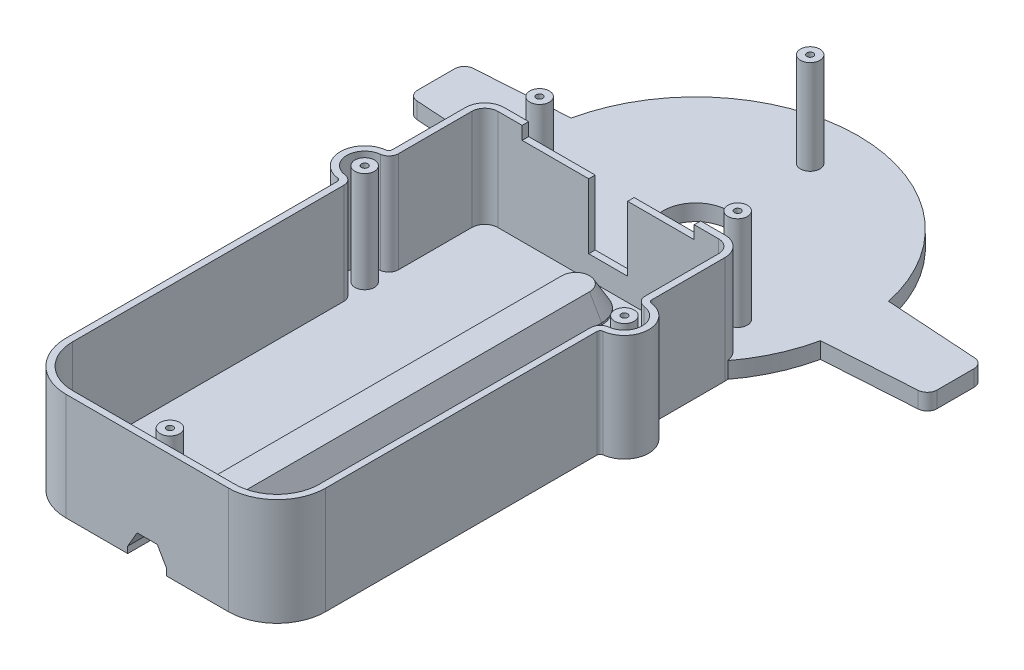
ISO-10303-21;
HEADER;
FILE_DESCRIPTION(('STEP AP214'),'2;1');
FILE_NAME('part.step','',(''),(''),'','','');
FILE_SCHEMA(('AUTOMOTIVE_DESIGN { 1 0 10303 214 1 1 1 1 }'));
ENDSEC;
DATA;
#1=APPLICATION_CONTEXT('core data for automotive mechanical design processes');
#2=APPLICATION_PROTOCOL_DEFINITION('international standard','automotive_design',2000,#1);
#3=PRODUCT_CONTEXT('',#1,'mechanical');
#4=PRODUCT('Part','Part','',(#3));
#5=PRODUCT_RELATED_PRODUCT_CATEGORY('part','',(#4));
#6=PRODUCT_DEFINITION_FORMATION('','',#4);
#7=PRODUCT_DEFINITION_CONTEXT('part definition',#1,'design');
#8=PRODUCT_DEFINITION('design','',#6,#7);
#9=PRODUCT_DEFINITION_SHAPE('','',#8);
#10=(LENGTH_UNIT() NAMED_UNIT(*) SI_UNIT(.MILLI.,.METRE.));
#11=(NAMED_UNIT(*) PLANE_ANGLE_UNIT() SI_UNIT($,.RADIAN.));
#12=(NAMED_UNIT(*) SI_UNIT($,.STERADIAN.) SOLID_ANGLE_UNIT());
#13=UNCERTAINTY_MEASURE_WITH_UNIT(LENGTH_MEASURE(1.E-05),#10,'distance_accuracy_value','');
#14=(GEOMETRIC_REPRESENTATION_CONTEXT(3) GLOBAL_UNCERTAINTY_ASSIGNED_CONTEXT((#13)) GLOBAL_UNIT_ASSIGNED_CONTEXT((#10,
#11,#12)) REPRESENTATION_CONTEXT('',''));
#15=CARTESIAN_POINT('',(0.,0.,0.));
#16=DIRECTION('',(0.,0.,1.));
#17=DIRECTION('',(1.,0.,0.));
#18=AXIS2_PLACEMENT_3D('',#15,#16,#17);
#19=CARTESIAN_POINT('',(0.,9.,169.));
#20=DIRECTION('',(0.,-1.,0.));
#21=DIRECTION('',(0.,0.,-1.));
#22=AXIS2_PLACEMENT_3D('',#19,#20,#21);
#23=PLANE('',#22);
#24=CARTESIAN_POINT('',(0.,9.,162.));
#25=DIRECTION('',(0.,1.,0.));
#26=DIRECTION('',(0.,0.,1.));
#27=AXIS2_PLACEMENT_3D('',#24,#25,#26);
#28=CIRCLE('',#27,1.);
#29=CARTESIAN_POINT('',(0.,9.,163.));
#30=VERTEX_POINT('',#29);
#31=EDGE_CURVE('E20',#30,#30,#28,.T.);
#32=ORIENTED_EDGE('',*,*,#31,.T.);
#33=EDGE_LOOP('',(#32));
#34=FACE_BOUND('',#33,.T.);
#35=ADVANCED_FACE('F17',(#34),#23,.F.);
#36=CARTESIAN_POINT('',(0.,2.,0.));
#37=DIRECTION('',(0.,1.,0.));
#38=DIRECTION('',(0.,0.,1.));
#39=AXIS2_PLACEMENT_3D('',#36,#37,#38);
#40=PLANE('',#39);
#41=CARTESIAN_POINT('',(40.,2.,62.));
#42=DIRECTION('',(0.,1.,0.));
#43=DIRECTION('',(0.,0.,1.));
#44=AXIS2_PLACEMENT_3D('',#41,#42,#43);
#45=CIRCLE('',#44,1.);
#46=CARTESIAN_POINT('',(40.,2.,63.));
#47=VERTEX_POINT('',#46);
#48=EDGE_CURVE('E640',#47,#47,#45,.T.);
#49=ORIENTED_EDGE('',*,*,#48,.T.);
#50=EDGE_LOOP('',(#49));
#51=FACE_BOUND('',#50,.T.);
#52=ADVANCED_FACE('F662',(#51),#40,.T.);
#53=CARTESIAN_POINT('',(0.,2.,0.));
#54=DIRECTION('',(0.,1.,0.));
#55=DIRECTION('',(0.,0.,1.));
#56=AXIS2_PLACEMENT_3D('',#53,#54,#55);
#57=PLANE('',#56);
#58=CARTESIAN_POINT('',(-40.,2.,62.));
#59=DIRECTION('',(0.,1.,0.));
#60=DIRECTION('',(0.,0.,1.));
#61=AXIS2_PLACEMENT_3D('',#58,#59,#60);
#62=CIRCLE('',#61,1.00000000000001);
#63=CARTESIAN_POINT('',(-40.,2.,63.));
#64=VERTEX_POINT('',#63);
#65=EDGE_CURVE('E638',#64,#64,#62,.T.);
#66=ORIENTED_EDGE('',*,*,#65,.T.);
#67=EDGE_LOOP('',(#66));
#68=FACE_BOUND('',#67,.T.);
#69=ADVANCED_FACE('F651',(#68),#57,.T.);
#70=CARTESIAN_POINT('',(0.,-0.002000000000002,162.));
#71=DIRECTION('',(0.,1.,0.));
#72=DIRECTION('',(0.,0.,1.));
#73=AXIS2_PLACEMENT_3D('',#70,#71,#72);
#74=CYLINDRICAL_SURFACE('',#73,1.);
#75=CARTESIAN_POINT('',(0.,33.,162.));
#76=DIRECTION('',(0.,1.,0.));
#77=DIRECTION('',(0.,0.,1.));
#78=AXIS2_PLACEMENT_3D('',#75,#76,#77);
#79=CIRCLE('',#78,1.);
#80=CARTESIAN_POINT('',(0.,33.,163.));
#81=VERTEX_POINT('',#80);
#82=EDGE_CURVE('E635',#81,#81,#79,.F.);
#83=ORIENTED_EDGE('',*,*,#82,.F.);
#84=EDGE_LOOP('',(#83));
#85=FACE_BOUND('',#84,.T.);
#86=ORIENTED_EDGE('',*,*,#31,.F.);
#87=EDGE_LOOP('',(#86));
#88=FACE_BOUND('',#87,.T.);
#89=ADVANCED_FACE('F648',(#85,#88),#74,.F.);
#90=CARTESIAN_POINT('',(40.,-0.002000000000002,62.));
#91=DIRECTION('',(0.,1.,0.));
#92=DIRECTION('',(0.,0.,1.));
#93=AXIS2_PLACEMENT_3D('',#90,#91,#92);
#94=CYLINDRICAL_SURFACE('',#93,1.);
#95=CARTESIAN_POINT('',(40.,33.,62.));
#96=DIRECTION('',(0.,1.,0.));
#97=DIRECTION('',(0.,0.,1.));
#98=AXIS2_PLACEMENT_3D('',#95,#96,#97);
#99=CIRCLE('',#98,1.);
#100=CARTESIAN_POINT('',(40.,33.,63.));
#101=VERTEX_POINT('',#100);
#102=EDGE_CURVE('E632',#101,#101,#99,.F.);
#103=ORIENTED_EDGE('',*,*,#102,.F.);
#104=EDGE_LOOP('',(#103));
#105=FACE_BOUND('',#104,.T.);
#106=ORIENTED_EDGE('',*,*,#48,.F.);
#107=EDGE_LOOP('',(#106));
#108=FACE_BOUND('',#107,.T.);
#109=ADVANCED_FACE('F650',(#105,#108),#94,.F.);
#110=CARTESIAN_POINT('',(-40.,-0.002000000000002,62.));
#111=DIRECTION('',(0.,1.,0.));
#112=DIRECTION('',(0.,0.,1.));
#113=AXIS2_PLACEMENT_3D('',#110,#111,#112);
#114=CYLINDRICAL_SURFACE('',#113,1.00000000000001);
#115=CARTESIAN_POINT('',(-40.,33.,62.));
#116=DIRECTION('',(0.,1.,0.));
#117=DIRECTION('',(0.,0.,1.));
#118=AXIS2_PLACEMENT_3D('',#115,#116,#117);
#119=CIRCLE('',#118,1.00000000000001);
#120=CARTESIAN_POINT('',(-40.,33.,63.));
#121=VERTEX_POINT('',#120);
#122=EDGE_CURVE('E629',#121,#121,#119,.F.);
#123=ORIENTED_EDGE('',*,*,#122,.F.);
#124=EDGE_LOOP('',(#123));
#125=FACE_BOUND('',#124,.T.);
#126=ORIENTED_EDGE('',*,*,#65,.F.);
#127=EDGE_LOOP('',(#126));
#128=FACE_BOUND('',#127,.T.);
#129=ADVANCED_FACE('F659',(#125,#128),#114,.F.);
#130=CARTESIAN_POINT('',(0.,33.,162.));
#131=DIRECTION('',(0.,1.,0.));
#132=DIRECTION('',(0.,0.,1.));
#133=AXIS2_PLACEMENT_3D('',#130,#131,#132);
#134=PLANE('',#133);
#135=CARTESIAN_POINT('',(0.,33.,162.));
#136=DIRECTION('',(0.,1.,0.));
#137=DIRECTION('',(0.,0.,1.));
#138=AXIS2_PLACEMENT_3D('',#135,#136,#137);
#139=CIRCLE('',#138,3.);
#140=CARTESIAN_POINT('',(0.,33.,165.));
#141=VERTEX_POINT('',#140);
#142=EDGE_CURVE('E626',#141,#141,#139,.F.);
#143=ORIENTED_EDGE('',*,*,#142,.F.);
#144=EDGE_LOOP('',(#143));
#145=FACE_BOUND('',#144,.T.);
#146=ORIENTED_EDGE('',*,*,#82,.T.);
#147=EDGE_LOOP('',(#146));
#148=FACE_BOUND('',#147,.T.);
#149=ADVANCED_FACE('F1012',(#145,#148),#134,.T.);
#150=CARTESIAN_POINT('',(40.,33.,62.));
#151=DIRECTION('',(0.,1.,0.));
#152=DIRECTION('',(0.,0.,1.));
#153=AXIS2_PLACEMENT_3D('',#150,#151,#152);
#154=PLANE('',#153);
#155=CARTESIAN_POINT('',(40.,33.,62.));
#156=DIRECTION('',(0.,1.,0.));
#157=DIRECTION('',(0.,0.,1.));
#158=AXIS2_PLACEMENT_3D('',#155,#156,#157);
#159=CIRCLE('',#158,3.);
#160=CARTESIAN_POINT('',(40.,33.,65.));
#161=VERTEX_POINT('',#160);
#162=EDGE_CURVE('E623',#161,#161,#159,.F.);
#163=ORIENTED_EDGE('',*,*,#162,.F.);
#164=EDGE_LOOP('',(#163));
#165=FACE_BOUND('',#164,.T.);
#166=ORIENTED_EDGE('',*,*,#102,.T.);
#167=EDGE_LOOP('',(#166));
#168=FACE_BOUND('',#167,.T.);
#169=ADVANCED_FACE('F1008',(#165,#168),#154,.T.);
#170=CARTESIAN_POINT('',(-40.,33.,62.));
#171=DIRECTION('',(0.,1.,0.));
#172=DIRECTION('',(0.,0.,1.));
#173=AXIS2_PLACEMENT_3D('',#170,#171,#172);
#174=PLANE('',#173);
#175=CARTESIAN_POINT('',(-40.,33.,62.));
#176=DIRECTION('',(0.,1.,0.));
#177=DIRECTION('',(0.,0.,1.));
#178=AXIS2_PLACEMENT_3D('',#175,#176,#177);
#179=CIRCLE('',#178,3.);
#180=CARTESIAN_POINT('',(-40.,33.,65.));
#181=VERTEX_POINT('',#180);
#182=EDGE_CURVE('E619',#181,#181,#179,.F.);
#183=ORIENTED_EDGE('',*,*,#182,.F.);
#184=EDGE_LOOP('',(#183));
#185=FACE_BOUND('',#184,.T.);
#186=ORIENTED_EDGE('',*,*,#122,.T.);
#187=EDGE_LOOP('',(#186));
#188=FACE_BOUND('',#187,.T.);
#189=ADVANCED_FACE('F1004',(#185,#188),#174,.T.);
#190=CARTESIAN_POINT('',(0.,5.,0.));
#191=DIRECTION('',(0.,1.,0.));
#192=DIRECTION('',(0.,0.,1.));
#193=AXIS2_PLACEMENT_3D('',#190,#191,#192);
#194=PLANE('',#193);
#195=CARTESIAN_POINT('',(0.,5.,-35.2183664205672));
#196=DIRECTION('',(0.,1.,0.));
#197=DIRECTION('',(0.,0.,1.));
#198=AXIS2_PLACEMENT_3D('',#195,#196,#197);
#199=CIRCLE('',#198,1.);
#200=CARTESIAN_POINT('',(0.,5.,-34.2183664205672));
#201=VERTEX_POINT('',#200);
#202=EDGE_CURVE('E615',#201,#201,#199,.T.);
#203=ORIENTED_EDGE('',*,*,#202,.T.);
#204=EDGE_LOOP('',(#203));
#205=FACE_BOUND('',#204,.T.);
#206=ADVANCED_FACE('F1000',(#205),#194,.T.);
#207=CARTESIAN_POINT('',(0.,5.,0.));
#208=DIRECTION('',(0.,1.,0.));
#209=DIRECTION('',(0.,0.,1.));
#210=AXIS2_PLACEMENT_3D('',#207,#208,#209);
#211=PLANE('',#210);
#212=CARTESIAN_POINT('',(30.5,5.,17.6091832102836));
#213=DIRECTION('',(0.,1.,0.));
#214=DIRECTION('',(0.,0.,1.));
#215=AXIS2_PLACEMENT_3D('',#212,#213,#214);
#216=CIRCLE('',#215,0.999999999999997);
#217=CARTESIAN_POINT('',(30.5,5.,18.6091832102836));
#218=VERTEX_POINT('',#217);
#219=EDGE_CURVE('E612',#218,#218,#216,.T.);
#220=ORIENTED_EDGE('',*,*,#219,.T.);
#221=EDGE_LOOP('',(#220));
#222=FACE_BOUND('',#221,.T.);
#223=ADVANCED_FACE('F996',(#222),#211,.T.);
#224=CARTESIAN_POINT('',(0.,5.,0.));
#225=DIRECTION('',(0.,1.,0.));
#226=DIRECTION('',(0.,0.,1.));
#227=AXIS2_PLACEMENT_3D('',#224,#225,#226);
#228=PLANE('',#227);
#229=CARTESIAN_POINT('',(-30.5,5.,17.6091832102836));
#230=DIRECTION('',(0.,1.,0.));
#231=DIRECTION('',(0.,0.,1.));
#232=AXIS2_PLACEMENT_3D('',#229,#230,#231);
#233=CIRCLE('',#232,1.);
#234=CARTESIAN_POINT('',(-30.5,5.,18.6091832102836));
#235=VERTEX_POINT('',#234);
#236=EDGE_CURVE('E608',#235,#235,#233,.T.);
#237=ORIENTED_EDGE('',*,*,#236,.T.);
#238=EDGE_LOOP('',(#237));
#239=FACE_BOUND('',#238,.T.);
#240=ADVANCED_FACE('F992',(#239),#228,.T.);
#241=CARTESIAN_POINT('',(0.,-0.002000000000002,162.));
#242=DIRECTION('',(0.,1.,0.));
#243=DIRECTION('',(0.,0.,1.));
#244=AXIS2_PLACEMENT_3D('',#241,#242,#243);
#245=CYLINDRICAL_SURFACE('',#244,3.);
#246=ORIENTED_EDGE('',*,*,#142,.T.);
#247=EDGE_LOOP('',(#246));
#248=FACE_BOUND('',#247,.T.);
#249=CARTESIAN_POINT('',(0.,9.,162.));
#250=DIRECTION('',(0.,1.,0.));
#251=DIRECTION('',(0.,0.,1.));
#252=AXIS2_PLACEMENT_3D('',#249,#250,#251);
#253=CIRCLE('',#252,3.);
#254=CARTESIAN_POINT('',(0.,9.,165.));
#255=VERTEX_POINT('',#254);
#256=EDGE_CURVE('E605',#255,#255,#253,.T.);
#257=ORIENTED_EDGE('',*,*,#256,.T.);
#258=EDGE_LOOP('',(#257));
#259=FACE_BOUND('',#258,.T.);
#260=ADVANCED_FACE('F988',(#248,#259),#245,.T.);
#261=CARTESIAN_POINT('',(0.,2.53589838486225,37.));
#262=DIRECTION('',(0.,-1.,0.));
#263=DIRECTION('',(0.,0.,-1.));
#264=AXIS2_PLACEMENT_3D('',#261,#262,#263);
#265=CONICAL_SURFACE('',#264,8.,0.5235987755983);
#266=CARTESIAN_POINT('',(0.,2.53589838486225,37.));
#267=DIRECTION('',(0.,-1.,0.));
#268=DIRECTION('',(0.,0.,-1.));
#269=AXIS2_PLACEMENT_3D('',#266,#267,#268);
#270=CIRCLE('',#269,8.);
#271=CARTESIAN_POINT('',(-7.99999999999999,2.53589838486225,37.));
#272=VERTEX_POINT('',#271);
#273=CARTESIAN_POINT('',(8.00000000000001,2.53589838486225,37.));
#274=VERTEX_POINT('',#273);
#275=EDGE_CURVE('E254',#272,#274,#270,.T.);
#276=ORIENTED_EDGE('',*,*,#275,.F.);
#277=DIRECTION('',(-0.500000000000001,-0.866025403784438,0.));
#278=VECTOR('',#277,1.);
#279=CARTESIAN_POINT('',(-7.73205080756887,2.99999999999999,37.));
#280=LINE('',#279,#278);
#281=CARTESIAN_POINT('',(-4.2679491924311,9.,37.));
#282=VERTEX_POINT('',#281);
#283=EDGE_CURVE('E600',#282,#272,#280,.T.);
#284=ORIENTED_EDGE('',*,*,#283,.F.);
#285=CARTESIAN_POINT('',(0.,9.,37.));
#286=DIRECTION('',(0.,-1.,0.));
#287=DIRECTION('',(0.,0.,-1.));
#288=AXIS2_PLACEMENT_3D('',#285,#286,#287);
#289=CIRCLE('',#288,4.26794919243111);
#290=CARTESIAN_POINT('',(4.26794919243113,9.,37.));
#291=VERTEX_POINT('',#290);
#292=EDGE_CURVE('E601',#282,#291,#289,.T.);
#293=ORIENTED_EDGE('',*,*,#292,.T.);
#294=DIRECTION('',(-0.500000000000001,0.866025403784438,0.));
#295=VECTOR('',#294,1.);
#296=CARTESIAN_POINT('',(7.73205080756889,3.,37.));
#297=LINE('',#296,#295);
#298=EDGE_CURVE('E244',#274,#291,#297,.T.);
#299=ORIENTED_EDGE('',*,*,#298,.F.);
#300=EDGE_LOOP('',(#276,#284,#293,#299));
#301=FACE_BOUND('',#300,.T.);
#302=ADVANCED_FACE('F984',(#301),#265,.T.);
#303=CARTESIAN_POINT('',(40.,-0.002000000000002,62.));
#304=DIRECTION('',(0.,1.,0.));
#305=DIRECTION('',(0.,0.,1.));
#306=AXIS2_PLACEMENT_3D('',#303,#304,#305);
#307=CYLINDRICAL_SURFACE('',#306,3.);
#308=CARTESIAN_POINT('',(40.,2.,62.));
#309=DIRECTION('',(0.,1.,0.));
#310=DIRECTION('',(0.,0.,1.));
#311=AXIS2_PLACEMENT_3D('',#308,#309,#310);
#312=CIRCLE('',#311,3.);
#313=CARTESIAN_POINT('',(40.,2.,65.));
#314=VERTEX_POINT('',#313);
#315=EDGE_CURVE('E597',#314,#314,#312,.F.);
#316=ORIENTED_EDGE('',*,*,#315,.F.);
#317=EDGE_LOOP('',(#316));
#318=FACE_BOUND('',#317,.T.);
#319=ORIENTED_EDGE('',*,*,#162,.T.);
#320=EDGE_LOOP('',(#319));
#321=FACE_BOUND('',#320,.T.);
#322=ADVANCED_FACE('F980',(#318,#321),#307,.T.);
#323=CARTESIAN_POINT('',(-40.,-0.002000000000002,62.));
#324=DIRECTION('',(0.,1.,0.));
#325=DIRECTION('',(0.,0.,1.));
#326=AXIS2_PLACEMENT_3D('',#323,#324,#325);
#327=CYLINDRICAL_SURFACE('',#326,3.);
#328=CARTESIAN_POINT('',(-40.,2.,62.));
#329=DIRECTION('',(0.,1.,0.));
#330=DIRECTION('',(0.,0.,1.));
#331=AXIS2_PLACEMENT_3D('',#328,#329,#330);
#332=CIRCLE('',#331,3.);
#333=CARTESIAN_POINT('',(-40.,2.,65.));
#334=VERTEX_POINT('',#333);
#335=EDGE_CURVE('E594',#334,#334,#332,.F.);
#336=ORIENTED_EDGE('',*,*,#335,.F.);
#337=EDGE_LOOP('',(#336));
#338=FACE_BOUND('',#337,.T.);
#339=ORIENTED_EDGE('',*,*,#182,.T.);
#340=EDGE_LOOP('',(#339));
#341=FACE_BOUND('',#340,.T.);
#342=ADVANCED_FACE('F976',(#338,#341),#327,.T.);
#343=CARTESIAN_POINT('',(-8.,2.,169.));
#344=DIRECTION('',(-1.,0.,0.));
#345=DIRECTION('',(0.,0.,1.));
#346=AXIS2_PLACEMENT_3D('',#343,#344,#345);
#347=PLANE('',#346);
#348=DIRECTION('',(0.,0.,1.));
#349=VECTOR('',#348,1.);
#350=CARTESIAN_POINT('',(-8.,2.53589838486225,169.));
#351=LINE('',#350,#349);
#352=CARTESIAN_POINT('',(-8.,2.53589838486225,167.));
#353=VERTEX_POINT('',#352);
#354=EDGE_CURVE('E1627',#272,#353,#351,.T.);
#355=ORIENTED_EDGE('',*,*,#354,.F.);
#356=DIRECTION('',(0.,-1.,0.));
#357=VECTOR('',#356,1.);
#358=CARTESIAN_POINT('',(-7.99999999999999,2.,37.));
#359=LINE('',#358,#357);
#360=CARTESIAN_POINT('',(-7.99999999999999,2.,37.));
#361=VERTEX_POINT('',#360);
#362=EDGE_CURVE('E1619',#361,#272,#359,.F.);
#363=ORIENTED_EDGE('',*,*,#362,.F.);
#364=DIRECTION('',(0.,0.,1.));
#365=VECTOR('',#364,1.);
#366=CARTESIAN_POINT('',(-8.,2.,0.));
#367=LINE('',#366,#365);
#368=CARTESIAN_POINT('',(-8.00000000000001,2.,167.));
#369=VERTEX_POINT('',#368);
#370=EDGE_CURVE('E593',#369,#361,#367,.F.);
#371=ORIENTED_EDGE('',*,*,#370,.F.);
#372=DIRECTION('',(0.,1.,0.));
#373=VECTOR('',#372,1.);
#374=CARTESIAN_POINT('',(-8.,2.,167.));
#375=LINE('',#374,#373);
#376=EDGE_CURVE('E622',#369,#353,#375,.T.);
#377=ORIENTED_EDGE('',*,*,#376,.T.);
#378=EDGE_LOOP('',(#355,#363,#371,#377));
#379=FACE_BOUND('',#378,.T.);
#380=ADVANCED_FACE('F973',(#379),#347,.T.);
#381=CARTESIAN_POINT('',(0.,2.,37.));
#382=DIRECTION('',(0.,-1.,0.));
#383=DIRECTION('',(0.,0.,-1.));
#384=AXIS2_PLACEMENT_3D('',#381,#382,#383);
#385=CYLINDRICAL_SURFACE('',#384,8.);
#386=DIRECTION('',(0.,1.,0.));
#387=VECTOR('',#386,1.);
#388=CARTESIAN_POINT('',(8.00000000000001,2.,37.));
#389=LINE('',#388,#387);
#390=CARTESIAN_POINT('',(8.00000000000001,2.,37.));
#391=VERTEX_POINT('',#390);
#392=EDGE_CURVE('E1618',#391,#274,#389,.T.);
#393=ORIENTED_EDGE('',*,*,#392,.F.);
#394=CARTESIAN_POINT('',(0.,2.,37.));
#395=DIRECTION('',(0.,-1.,0.));
#396=DIRECTION('',(0.,0.,-1.));
#397=AXIS2_PLACEMENT_3D('',#394,#395,#396);
#398=CIRCLE('',#397,8.);
#399=EDGE_CURVE('E591',#361,#391,#398,.T.);
#400=ORIENTED_EDGE('',*,*,#399,.F.);
#401=ORIENTED_EDGE('',*,*,#362,.T.);
#402=ORIENTED_EDGE('',*,*,#275,.T.);
#403=EDGE_LOOP('',(#393,#400,#401,#402));
#404=FACE_BOUND('',#403,.T.);
#405=ADVANCED_FACE('F969',(#404),#385,.T.);
#406=CARTESIAN_POINT('',(8.,2.,169.));
#407=DIRECTION('',(1.,0.,0.));
#408=DIRECTION('',(0.,0.,-1.));
#409=AXIS2_PLACEMENT_3D('',#406,#407,#408);
#410=PLANE('',#409);
#411=DIRECTION('',(0.,0.,1.));
#412=VECTOR('',#411,1.);
#413=CARTESIAN_POINT('',(8.00000000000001,2.53589838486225,37.));
#414=LINE('',#413,#412);
#415=CARTESIAN_POINT('',(7.99999999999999,2.53589838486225,167.));
#416=VERTEX_POINT('',#415);
#417=EDGE_CURVE('E611',#416,#274,#414,.F.);
#418=ORIENTED_EDGE('',*,*,#417,.F.);
#419=DIRECTION('',(0.,1.,0.));
#420=VECTOR('',#419,1.);
#421=CARTESIAN_POINT('',(8.,2.,167.));
#422=LINE('',#421,#420);
#423=CARTESIAN_POINT('',(8.,2.,167.));
#424=VERTEX_POINT('',#423);
#425=EDGE_CURVE('E618',#416,#424,#422,.F.);
#426=ORIENTED_EDGE('',*,*,#425,.T.);
#427=DIRECTION('',(0.,0.,1.));
#428=VECTOR('',#427,1.);
#429=CARTESIAN_POINT('',(8.00000000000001,2.,0.));
#430=LINE('',#429,#428);
#431=EDGE_CURVE('E590',#391,#424,#430,.T.);
#432=ORIENTED_EDGE('',*,*,#431,.F.);
#433=ORIENTED_EDGE('',*,*,#392,.T.);
#434=EDGE_LOOP('',(#418,#426,#432,#433));
#435=FACE_BOUND('',#434,.T.);
#436=ADVANCED_FACE('F965',(#435),#410,.T.);
#437=CARTESIAN_POINT('',(0.,-0.002000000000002,-35.2183664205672));
#438=DIRECTION('',(0.,1.,0.));
#439=DIRECTION('',(0.,0.,1.));
#440=AXIS2_PLACEMENT_3D('',#437,#438,#439);
#441=CYLINDRICAL_SURFACE('',#440,1.);
#442=CARTESIAN_POINT('',(0.,34.,-35.2183664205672));
#443=DIRECTION('',(0.,1.,0.));
#444=DIRECTION('',(0.,0.,1.));
#445=AXIS2_PLACEMENT_3D('',#442,#443,#444);
#446=CIRCLE('',#445,1.);
#447=CARTESIAN_POINT('',(0.,34.,-34.2183664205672));
#448=VERTEX_POINT('',#447);
#449=EDGE_CURVE('E587',#448,#448,#446,.F.);
#450=ORIENTED_EDGE('',*,*,#449,.F.);
#451=EDGE_LOOP('',(#450));
#452=FACE_BOUND('',#451,.T.);
#453=ORIENTED_EDGE('',*,*,#202,.F.);
#454=EDGE_LOOP('',(#453));
#455=FACE_BOUND('',#454,.T.);
#456=ADVANCED_FACE('F961',(#452,#455),#441,.F.);
#457=CARTESIAN_POINT('',(30.5,-0.002000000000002,17.6091832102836));
#458=DIRECTION('',(0.,1.,0.));
#459=DIRECTION('',(0.,0.,1.));
#460=AXIS2_PLACEMENT_3D('',#457,#458,#459);
#461=CYLINDRICAL_SURFACE('',#460,0.999999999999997);
#462=CARTESIAN_POINT('',(30.5,34.,17.6091832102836));
#463=DIRECTION('',(0.,1.,0.));
#464=DIRECTION('',(0.,0.,1.));
#465=AXIS2_PLACEMENT_3D('',#462,#463,#464);
#466=CIRCLE('',#465,0.999999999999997);
#467=CARTESIAN_POINT('',(30.5,34.,18.6091832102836));
#468=VERTEX_POINT('',#467);
#469=EDGE_CURVE('E584',#468,#468,#466,.F.);
#470=ORIENTED_EDGE('',*,*,#469,.F.);
#471=EDGE_LOOP('',(#470));
#472=FACE_BOUND('',#471,.T.);
#473=ORIENTED_EDGE('',*,*,#219,.F.);
#474=EDGE_LOOP('',(#473));
#475=FACE_BOUND('',#474,.T.);
#476=ADVANCED_FACE('F957',(#472,#475),#461,.F.);
#477=CARTESIAN_POINT('',(-30.5,-0.002000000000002,17.6091832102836));
#478=DIRECTION('',(0.,1.,0.));
#479=DIRECTION('',(0.,0.,1.));
#480=AXIS2_PLACEMENT_3D('',#477,#478,#479);
#481=CYLINDRICAL_SURFACE('',#480,1.);
#482=CARTESIAN_POINT('',(-30.5,34.,17.6091832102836));
#483=DIRECTION('',(0.,1.,0.));
#484=DIRECTION('',(0.,0.,1.));
#485=AXIS2_PLACEMENT_3D('',#482,#483,#484);
#486=CIRCLE('',#485,1.);
#487=CARTESIAN_POINT('',(-30.5,34.,18.6091832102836));
#488=VERTEX_POINT('',#487);
#489=EDGE_CURVE('E580',#488,#488,#486,.F.);
#490=ORIENTED_EDGE('',*,*,#489,.F.);
#491=EDGE_LOOP('',(#490));
#492=FACE_BOUND('',#491,.T.);
#493=ORIENTED_EDGE('',*,*,#236,.F.);
#494=EDGE_LOOP('',(#493));
#495=FACE_BOUND('',#494,.T.);
#496=ADVANCED_FACE('F954',(#492,#495),#481,.F.);
#497=CARTESIAN_POINT('',(7.73205080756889,3.,37.));
#498=DIRECTION('',(0.866025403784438,0.500000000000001,0.));
#499=DIRECTION('',(-0.500000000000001,0.866025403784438,0.));
#500=AXIS2_PLACEMENT_3D('',#497,#498,#499);
#501=PLANE('',#500);
#502=DIRECTION('',(0.,0.,-1.));
#503=VECTOR('',#502,1.);
#504=CARTESIAN_POINT('',(4.26794919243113,9.,169.));
#505=LINE('',#504,#503);
#506=CARTESIAN_POINT('',(4.26794919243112,9.,167.));
#507=VERTEX_POINT('',#506);
#508=EDGE_CURVE('E604',#291,#507,#505,.F.);
#509=ORIENTED_EDGE('',*,*,#508,.T.);
#510=DIRECTION('',(-0.500000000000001,0.866025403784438,0.));
#511=VECTOR('',#510,1.);
#512=CARTESIAN_POINT('',(7.99999999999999,2.53589838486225,167.));
#513=LINE('',#512,#511);
#514=EDGE_CURVE('E1645',#416,#507,#513,.T.);
#515=ORIENTED_EDGE('',*,*,#514,.F.);
#516=ORIENTED_EDGE('',*,*,#417,.T.);
#517=ORIENTED_EDGE('',*,*,#298,.T.);
#518=EDGE_LOOP('',(#509,#515,#516,#517));
#519=FACE_BOUND('',#518,.T.);
#520=ADVANCED_FACE('F950',(#519),#501,.T.);
#521=CARTESIAN_POINT('',(0.,9.,169.));
#522=DIRECTION('',(0.,-1.,0.));
#523=DIRECTION('',(0.,0.,-1.));
#524=AXIS2_PLACEMENT_3D('',#521,#522,#523);
#525=PLANE('',#524);
#526=ORIENTED_EDGE('',*,*,#508,.F.);
#527=ORIENTED_EDGE('',*,*,#292,.F.);
#528=DIRECTION('',(0.,0.,1.));
#529=VECTOR('',#528,1.);
#530=CARTESIAN_POINT('',(-4.26794919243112,9.,169.));
#531=LINE('',#530,#529);
#532=CARTESIAN_POINT('',(-4.26794919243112,9.,167.));
#533=VERTEX_POINT('',#532);
#534=EDGE_CURVE('E1630',#533,#282,#531,.F.);
#535=ORIENTED_EDGE('',*,*,#534,.F.);
#536=DIRECTION('',(-1.,0.,0.));
#537=VECTOR('',#536,1.);
#538=CARTESIAN_POINT('',(40.,9.,167.));
#539=LINE('',#538,#537);
#540=EDGE_CURVE('E1641',#507,#533,#539,.T.);
#541=ORIENTED_EDGE('',*,*,#540,.F.);
#542=EDGE_LOOP('',(#526,#527,#535,#541));
#543=FACE_BOUND('',#542,.T.);
#544=ORIENTED_EDGE('',*,*,#256,.F.);
#545=EDGE_LOOP('',(#544));
#546=FACE_BOUND('',#545,.T.);
#547=ADVANCED_FACE('F946',(#543,#546),#525,.F.);
#548=CARTESIAN_POINT('',(-7.73205080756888,3.,169.));
#549=DIRECTION('',(-0.866025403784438,0.500000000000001,0.));
#550=DIRECTION('',(-0.500000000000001,-0.866025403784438,0.));
#551=AXIS2_PLACEMENT_3D('',#548,#549,#550);
#552=PLANE('',#551);
#553=ORIENTED_EDGE('',*,*,#534,.T.);
#554=ORIENTED_EDGE('',*,*,#283,.T.);
#555=ORIENTED_EDGE('',*,*,#354,.T.);
#556=DIRECTION('',(-0.500000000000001,-0.866025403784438,0.));
#557=VECTOR('',#556,1.);
#558=CARTESIAN_POINT('',(-4.26794919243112,9.,167.));
#559=LINE('',#558,#557);
#560=EDGE_CURVE('E1644',#533,#353,#559,.T.);
#561=ORIENTED_EDGE('',*,*,#560,.F.);
#562=EDGE_LOOP('',(#553,#554,#555,#561));
#563=FACE_BOUND('',#562,.T.);
#564=ADVANCED_FACE('F942',(#563),#552,.T.);
#565=CARTESIAN_POINT('',(0.,2.,0.));
#566=DIRECTION('',(0.,1.,0.));
#567=DIRECTION('',(0.,0.,1.));
#568=AXIS2_PLACEMENT_3D('',#565,#566,#567);
#569=PLANE('',#568);
#570=DIRECTION('',(0.,0.,1.));
#571=VECTOR('',#570,1.);
#572=CARTESIAN_POINT('',(38.,2.,54.5));
#573=LINE('',#572,#571);
#574=CARTESIAN_POINT('',(38.,2.,31.));
#575=VERTEX_POINT('',#574);
#576=CARTESIAN_POINT('',(38.,2.,53.5590284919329));
#577=VERTEX_POINT('',#576);
#578=EDGE_CURVE('E1921',#575,#577,#573,.T.);
#579=ORIENTED_EDGE('',*,*,#578,.F.);
#580=CARTESIAN_POINT('',(34.,2.,31.));
#581=DIRECTION('',(0.,-1.,0.));
#582=DIRECTION('',(0.,0.,-1.));
#583=AXIS2_PLACEMENT_3D('',#580,#581,#582);
#584=CIRCLE('',#583,4.);
#585=CARTESIAN_POINT('',(34.,2.,27.));
#586=VERTEX_POINT('',#585);
#587=EDGE_CURVE('E538',#575,#586,#584,.F.);
#588=ORIENTED_EDGE('',*,*,#587,.T.);
#589=DIRECTION('',(1.,0.,0.));
#590=VECTOR('',#589,1.);
#591=CARTESIAN_POINT('',(-40.,2.,27.));
#592=LINE('',#591,#590);
#593=CARTESIAN_POINT('',(-34.,2.,27.));
#594=VERTEX_POINT('',#593);
#595=EDGE_CURVE('E1916',#594,#586,#592,.T.);
#596=ORIENTED_EDGE('',*,*,#595,.F.);
#597=CARTESIAN_POINT('',(-34.,2.,31.));
#598=DIRECTION('',(0.,-1.,0.));
#599=DIRECTION('',(0.,0.,-1.));
#600=AXIS2_PLACEMENT_3D('',#597,#598,#599);
#601=CIRCLE('',#600,4.);
#602=CARTESIAN_POINT('',(-38.,2.,31.));
#603=VERTEX_POINT('',#602);
#604=EDGE_CURVE('E575',#594,#603,#601,.F.);
#605=ORIENTED_EDGE('',*,*,#604,.T.);
#606=DIRECTION('',(0.,0.,-1.));
#607=VECTOR('',#606,1.);
#608=CARTESIAN_POINT('',(-38.,2.,54.5));
#609=LINE('',#608,#607);
#610=CARTESIAN_POINT('',(-38.,2.,53.559028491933));
#611=VERTEX_POINT('',#610);
#612=EDGE_CURVE('E578',#611,#603,#609,.T.);
#613=ORIENTED_EDGE('',*,*,#612,.F.);
#614=CARTESIAN_POINT('',(-41.,2.,53.559028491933));
#615=DIRECTION('',(0.,-1.,0.));
#616=DIRECTION('',(0.,0.,-1.));
#617=AXIS2_PLACEMENT_3D('',#614,#615,#616);
#618=CIRCLE('',#617,3.);
#619=CARTESIAN_POINT('',(-40.6470588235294,2.,56.5381949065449));
#620=VERTEX_POINT('',#619);
#621=EDGE_CURVE('E571',#620,#611,#618,.F.);
#622=ORIENTED_EDGE('',*,*,#621,.F.);
#623=CARTESIAN_POINT('',(-40.,2.,62.));
#624=DIRECTION('',(0.,-1.,0.));
#625=DIRECTION('',(0.,0.,-1.));
#626=AXIS2_PLACEMENT_3D('',#623,#624,#625);
#627=CIRCLE('',#626,5.5);
#628=CARTESIAN_POINT('',(-40.6470588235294,2.,67.4618050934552));
#629=VERTEX_POINT('',#628);
#630=EDGE_CURVE('E567',#620,#629,#627,.F.);
#631=ORIENTED_EDGE('',*,*,#630,.T.);
#632=CARTESIAN_POINT('',(-41.,2.,70.4409715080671));
#633=DIRECTION('',(0.,-1.,0.));
#634=DIRECTION('',(0.,0.,-1.));
#635=AXIS2_PLACEMENT_3D('',#632,#633,#634);
#636=CIRCLE('',#635,3.);
#637=CARTESIAN_POINT('',(-38.,2.,70.4409715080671));
#638=VERTEX_POINT('',#637);
#639=EDGE_CURVE('E564',#638,#629,#636,.F.);
#640=ORIENTED_EDGE('',*,*,#639,.F.);
#641=DIRECTION('',(0.,0.,-1.));
#642=VECTOR('',#641,1.);
#643=CARTESIAN_POINT('',(-38.,2.,169.));
#644=LINE('',#643,#642);
#645=CARTESIAN_POINT('',(-38.,2.,154.));
#646=VERTEX_POINT('',#645);
#647=EDGE_CURVE('E1935',#646,#638,#644,.T.);
#648=ORIENTED_EDGE('',*,*,#647,.F.);
#649=CARTESIAN_POINT('',(-25.,2.,154.));
#650=DIRECTION('',(0.,-1.,0.));
#651=DIRECTION('',(0.,0.,-1.));
#652=AXIS2_PLACEMENT_3D('',#649,#650,#651);
#653=CIRCLE('',#652,13.);
#654=CARTESIAN_POINT('',(-25.,2.,167.));
#655=VERTEX_POINT('',#654);
#656=EDGE_CURVE('E559',#646,#655,#653,.F.);
#657=ORIENTED_EDGE('',*,*,#656,.T.);
#658=DIRECTION('',(-1.,0.,0.));
#659=VECTOR('',#658,1.);
#660=CARTESIAN_POINT('',(40.,2.,167.));
#661=LINE('',#660,#659);
#662=EDGE_CURVE('E1649',#369,#655,#661,.T.);
#663=ORIENTED_EDGE('',*,*,#662,.F.);
#664=ORIENTED_EDGE('',*,*,#370,.T.);
#665=ORIENTED_EDGE('',*,*,#399,.T.);
#666=ORIENTED_EDGE('',*,*,#431,.T.);
#667=DIRECTION('',(-1.,0.,0.));
#668=VECTOR('',#667,1.);
#669=CARTESIAN_POINT('',(40.,2.,167.));
#670=LINE('',#669,#668);
#671=CARTESIAN_POINT('',(25.,2.,167.));
#672=VERTEX_POINT('',#671);
#673=EDGE_CURVE('E562',#672,#424,#670,.T.);
#674=ORIENTED_EDGE('',*,*,#673,.F.);
#675=CARTESIAN_POINT('',(25.,2.,154.));
#676=DIRECTION('',(0.,-1.,0.));
#677=DIRECTION('',(0.,0.,-1.));
#678=AXIS2_PLACEMENT_3D('',#675,#676,#677);
#679=CIRCLE('',#678,13.);
#680=CARTESIAN_POINT('',(38.,2.,154.));
#681=VERTEX_POINT('',#680);
#682=EDGE_CURVE('E554',#672,#681,#679,.F.);
#683=ORIENTED_EDGE('',*,*,#682,.T.);
#684=DIRECTION('',(0.,0.,1.));
#685=VECTOR('',#684,1.);
#686=CARTESIAN_POINT('',(38.,2.,169.));
#687=LINE('',#686,#685);
#688=CARTESIAN_POINT('',(38.,2.,70.4409715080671));
#689=VERTEX_POINT('',#688);
#690=EDGE_CURVE('E557',#689,#681,#687,.T.);
#691=ORIENTED_EDGE('',*,*,#690,.F.);
#692=CARTESIAN_POINT('',(41.,2.,70.4409715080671));
#693=DIRECTION('',(0.,-1.,0.));
#694=DIRECTION('',(0.,0.,-1.));
#695=AXIS2_PLACEMENT_3D('',#692,#693,#694);
#696=CIRCLE('',#695,3.);
#697=CARTESIAN_POINT('',(40.6470588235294,2.,67.4618050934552));
#698=VERTEX_POINT('',#697);
#699=EDGE_CURVE('E550',#698,#689,#696,.F.);
#700=ORIENTED_EDGE('',*,*,#699,.F.);
#701=CARTESIAN_POINT('',(40.,2.,62.));
#702=DIRECTION('',(0.,-1.,0.));
#703=DIRECTION('',(0.,0.,-1.));
#704=AXIS2_PLACEMENT_3D('',#701,#702,#703);
#705=CIRCLE('',#704,5.5);
#706=CARTESIAN_POINT('',(40.6470588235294,2.,56.5381949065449));
#707=VERTEX_POINT('',#706);
#708=EDGE_CURVE('E546',#698,#707,#705,.F.);
#709=ORIENTED_EDGE('',*,*,#708,.T.);
#710=CARTESIAN_POINT('',(41.,2.,53.5590284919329));
#711=DIRECTION('',(0.,-1.,0.));
#712=DIRECTION('',(0.,0.,-1.));
#713=AXIS2_PLACEMENT_3D('',#710,#711,#712);
#714=CIRCLE('',#713,3.);
#715=EDGE_CURVE('E543',#577,#707,#714,.F.);
#716=ORIENTED_EDGE('',*,*,#715,.F.);
#717=EDGE_LOOP('',(#579,#588,#596,#605,#613,#622,#631,#640,#648,#657,#663,#664,#665,#666,#674,
#683,#691,#700,#709,#716));
#718=FACE_BOUND('',#717,.T.);
#719=ORIENTED_EDGE('',*,*,#335,.T.);
#720=EDGE_LOOP('',(#719));
#721=FACE_BOUND('',#720,.T.);
#722=ORIENTED_EDGE('',*,*,#315,.T.);
#723=EDGE_LOOP('',(#722));
#724=FACE_BOUND('',#723,.T.);
#725=ADVANCED_FACE('F938',(#718,#721,#724),#569,.T.);
#726=CARTESIAN_POINT('',(0.,34.,-35.2183664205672));
#727=DIRECTION('',(0.,1.,0.));
#728=DIRECTION('',(0.,0.,1.));
#729=AXIS2_PLACEMENT_3D('',#726,#727,#728);
#730=PLANE('',#729);
#731=CARTESIAN_POINT('',(0.,34.,-35.2183664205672));
#732=DIRECTION('',(0.,1.,0.));
#733=DIRECTION('',(0.,0.,1.));
#734=AXIS2_PLACEMENT_3D('',#731,#732,#733);
#735=CIRCLE('',#734,3.);
#736=CARTESIAN_POINT('',(0.,34.,-32.2183664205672));
#737=VERTEX_POINT('',#736);
#738=EDGE_CURVE('E534',#737,#737,#735,.F.);
#739=ORIENTED_EDGE('',*,*,#738,.F.);
#740=EDGE_LOOP('',(#739));
#741=FACE_BOUND('',#740,.T.);
#742=ORIENTED_EDGE('',*,*,#449,.T.);
#743=EDGE_LOOP('',(#742));
#744=FACE_BOUND('',#743,.T.);
#745=ADVANCED_FACE('F934',(#741,#744),#730,.T.);
#746=CARTESIAN_POINT('',(30.5,34.,17.6091832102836));
#747=DIRECTION('',(0.,1.,0.));
#748=DIRECTION('',(0.,0.,1.));
#749=AXIS2_PLACEMENT_3D('',#746,#747,#748);
#750=PLANE('',#749);
#751=CARTESIAN_POINT('',(30.5,34.,17.6091832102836));
#752=DIRECTION('',(0.,1.,0.));
#753=DIRECTION('',(0.,0.,1.));
#754=AXIS2_PLACEMENT_3D('',#751,#752,#753);
#755=CIRCLE('',#754,3.);
#756=CARTESIAN_POINT('',(30.5,34.,20.6091832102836));
#757=VERTEX_POINT('',#756);
#758=EDGE_CURVE('E531',#757,#757,#755,.F.);
#759=ORIENTED_EDGE('',*,*,#758,.F.);
#760=EDGE_LOOP('',(#759));
#761=FACE_BOUND('',#760,.T.);
#762=ORIENTED_EDGE('',*,*,#469,.T.);
#763=EDGE_LOOP('',(#762));
#764=FACE_BOUND('',#763,.T.);
#765=ADVANCED_FACE('F930',(#761,#764),#750,.T.);
#766=CARTESIAN_POINT('',(-30.5,34.,17.6091832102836));
#767=DIRECTION('',(0.,1.,0.));
#768=DIRECTION('',(0.,0.,1.));
#769=AXIS2_PLACEMENT_3D('',#766,#767,#768);
#770=PLANE('',#769);
#771=CARTESIAN_POINT('',(-30.5,34.,17.6091832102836));
#772=DIRECTION('',(0.,1.,0.));
#773=DIRECTION('',(0.,0.,1.));
#774=AXIS2_PLACEMENT_3D('',#771,#772,#773);
#775=CIRCLE('',#774,3.00000000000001);
#776=CARTESIAN_POINT('',(-30.5,34.,20.6091832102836));
#777=VERTEX_POINT('',#776);
#778=EDGE_CURVE('E527',#777,#777,#775,.F.);
#779=ORIENTED_EDGE('',*,*,#778,.F.);
#780=EDGE_LOOP('',(#779));
#781=FACE_BOUND('',#780,.T.);
#782=ORIENTED_EDGE('',*,*,#489,.T.);
#783=EDGE_LOOP('',(#782));
#784=FACE_BOUND('',#783,.T.);
#785=ADVANCED_FACE('F926',(#781,#784),#770,.T.);
#786=CARTESIAN_POINT('',(-6.,9.,29.));
#787=DIRECTION('',(-1.,0.,0.));
#788=DIRECTION('',(0.,0.,1.));
#789=AXIS2_PLACEMENT_3D('',#786,#787,#788);
#790=PLANE('',#789);
#791=DIRECTION('',(0.,0.,-1.));
#792=VECTOR('',#791,1.);
#793=CARTESIAN_POINT('',(-6.,9.,0.));
#794=LINE('',#793,#792);
#795=CARTESIAN_POINT('',(-6.,9.,27.));
#796=VERTEX_POINT('',#795);
#797=CARTESIAN_POINT('',(-6.,9.,25.));
#798=VERTEX_POINT('',#797);
#799=EDGE_CURVE('E1986',#796,#798,#794,.T.);
#800=ORIENTED_EDGE('',*,*,#799,.T.);
#801=DIRECTION('',(0.,1.,0.));
#802=VECTOR('',#801,1.);
#803=CARTESIAN_POINT('',(-6.00000000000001,33.,25.));
#804=LINE('',#803,#802);
#805=CARTESIAN_POINT('',(-6.,29.,25.));
#806=VERTEX_POINT('',#805);
#807=EDGE_CURVE('E530',#798,#806,#804,.T.);
#808=ORIENTED_EDGE('',*,*,#807,.T.);
#809=DIRECTION('',(0.,0.,-1.));
#810=VECTOR('',#809,1.);
#811=CARTESIAN_POINT('',(-6.,29.,0.));
#812=LINE('',#811,#810);
#813=CARTESIAN_POINT('',(-6.,29.,27.));
#814=VERTEX_POINT('',#813);
#815=EDGE_CURVE('E583',#806,#814,#812,.F.);
#816=ORIENTED_EDGE('',*,*,#815,.T.);
#817=DIRECTION('',(0.,1.,0.));
#818=VECTOR('',#817,1.);
#819=CARTESIAN_POINT('',(-6.00000000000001,33.,27.));
#820=LINE('',#819,#818);
#821=EDGE_CURVE('E2014',#796,#814,#820,.T.);
#822=ORIENTED_EDGE('',*,*,#821,.F.);
#823=EDGE_LOOP('',(#800,#808,#816,#822));
#824=FACE_BOUND('',#823,.T.);
#825=ADVANCED_FACE('F922',(#824),#790,.F.);
#826=CARTESIAN_POINT('',(0.,29.,0.));
#827=DIRECTION('',(0.,-1.,0.));
#828=DIRECTION('',(0.,0.,-1.));
#829=AXIS2_PLACEMENT_3D('',#826,#827,#828);
#830=PLANE('',#829);
#831=ORIENTED_EDGE('',*,*,#815,.F.);
#832=DIRECTION('',(1.,0.,0.));
#833=VECTOR('',#832,1.);
#834=CARTESIAN_POINT('',(-40.,29.,25.));
#835=LINE('',#834,#833);
#836=CARTESIAN_POINT('',(-26.5,29.,25.));
#837=VERTEX_POINT('',#836);
#838=EDGE_CURVE('E1956',#806,#837,#835,.F.);
#839=ORIENTED_EDGE('',*,*,#838,.T.);
#840=DIRECTION('',(0.,0.,1.));
#841=VECTOR('',#840,1.);
#842=CARTESIAN_POINT('',(-26.5,29.,29.));
#843=LINE('',#842,#841);
#844=CARTESIAN_POINT('',(-26.5,29.,27.));
#845=VERTEX_POINT('',#844);
#846=EDGE_CURVE('E579',#837,#845,#843,.T.);
#847=ORIENTED_EDGE('',*,*,#846,.T.);
#848=DIRECTION('',(1.,0.,0.));
#849=VECTOR('',#848,1.);
#850=CARTESIAN_POINT('',(-40.,29.,27.));
#851=LINE('',#850,#849);
#852=EDGE_CURVE('E1947',#814,#845,#851,.F.);
#853=ORIENTED_EDGE('',*,*,#852,.F.);
#854=EDGE_LOOP('',(#831,#839,#847,#853));
#855=FACE_BOUND('',#854,.T.);
#856=ADVANCED_FACE('F918',(#855),#830,.F.);
#857=CARTESIAN_POINT('',(0.,29.,0.));
#858=DIRECTION('',(0.,-1.,0.));
#859=DIRECTION('',(0.,0.,-1.));
#860=AXIS2_PLACEMENT_3D('',#857,#858,#859);
#861=PLANE('',#860);
#862=DIRECTION('',(0.,0.,-1.));
#863=VECTOR('',#862,1.);
#864=CARTESIAN_POINT('',(6.00000000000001,29.,29.));
#865=LINE('',#864,#863);
#866=CARTESIAN_POINT('',(6.00000000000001,29.,25.));
#867=VERTEX_POINT('',#866);
#868=CARTESIAN_POINT('',(6.00000000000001,29.,27.));
#869=VERTEX_POINT('',#868);
#870=EDGE_CURVE('E1979',#867,#869,#865,.F.);
#871=ORIENTED_EDGE('',*,*,#870,.T.);
#872=DIRECTION('',(1.,0.,0.));
#873=VECTOR('',#872,1.);
#874=CARTESIAN_POINT('',(-40.,29.,27.));
#875=LINE('',#874,#873);
#876=CARTESIAN_POINT('',(26.5,29.,27.));
#877=VERTEX_POINT('',#876);
#878=EDGE_CURVE('E1915',#877,#869,#875,.F.);
#879=ORIENTED_EDGE('',*,*,#878,.F.);
#880=DIRECTION('',(0.,0.,-1.));
#881=VECTOR('',#880,1.);
#882=CARTESIAN_POINT('',(26.5,29.,29.));
#883=LINE('',#882,#881);
#884=CARTESIAN_POINT('',(26.5,29.,25.));
#885=VERTEX_POINT('',#884);
#886=EDGE_CURVE('E1910',#877,#885,#883,.T.);
#887=ORIENTED_EDGE('',*,*,#886,.T.);
#888=DIRECTION('',(1.,0.,0.));
#889=VECTOR('',#888,1.);
#890=CARTESIAN_POINT('',(-40.,29.,25.));
#891=LINE('',#890,#889);
#892=EDGE_CURVE('E1900',#885,#867,#891,.F.);
#893=ORIENTED_EDGE('',*,*,#892,.T.);
#894=EDGE_LOOP('',(#871,#879,#887,#893));
#895=FACE_BOUND('',#894,.T.);
#896=ADVANCED_FACE('F914',(#895),#861,.F.);
#897=CARTESIAN_POINT('',(6.00000000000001,9.,29.));
#898=DIRECTION('',(1.,0.,0.));
#899=DIRECTION('',(0.,0.,-1.));
#900=AXIS2_PLACEMENT_3D('',#897,#898,#899);
#901=PLANE('',#900);
#902=ORIENTED_EDGE('',*,*,#870,.F.);
#903=DIRECTION('',(0.,1.,0.));
#904=VECTOR('',#903,1.);
#905=CARTESIAN_POINT('',(6.00000000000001,33.,25.));
#906=LINE('',#905,#904);
#907=CARTESIAN_POINT('',(6.00000000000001,9.,25.));
#908=VERTEX_POINT('',#907);
#909=EDGE_CURVE('E1965',#867,#908,#906,.F.);
#910=ORIENTED_EDGE('',*,*,#909,.T.);
#911=DIRECTION('',(0.,0.,-1.));
#912=VECTOR('',#911,1.);
#913=CARTESIAN_POINT('',(6.00000000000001,9.,0.));
#914=LINE('',#913,#912);
#915=CARTESIAN_POINT('',(6.00000000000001,9.,27.));
#916=VERTEX_POINT('',#915);
#917=EDGE_CURVE('E1970',#908,#916,#914,.F.);
#918=ORIENTED_EDGE('',*,*,#917,.T.);
#919=DIRECTION('',(0.,1.,0.));
#920=VECTOR('',#919,1.);
#921=CARTESIAN_POINT('',(6.00000000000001,33.,27.));
#922=LINE('',#921,#920);
#923=EDGE_CURVE('E541',#869,#916,#922,.F.);
#924=ORIENTED_EDGE('',*,*,#923,.F.);
#925=EDGE_LOOP('',(#902,#910,#918,#924));
#926=FACE_BOUND('',#925,.T.);
#927=ADVANCED_FACE('F910',(#926),#901,.F.);
#928=CARTESIAN_POINT('',(0.,9.,0.));
#929=DIRECTION('',(0.,-1.,0.));
#930=DIRECTION('',(0.,0.,-1.));
#931=AXIS2_PLACEMENT_3D('',#928,#929,#930);
#932=PLANE('',#931);
#933=ORIENTED_EDGE('',*,*,#917,.F.);
#934=DIRECTION('',(1.,0.,0.));
#935=VECTOR('',#934,1.);
#936=CARTESIAN_POINT('',(-40.,9.,25.));
#937=LINE('',#936,#935);
#938=EDGE_CURVE('E526',#908,#798,#937,.F.);
#939=ORIENTED_EDGE('',*,*,#938,.T.);
#940=ORIENTED_EDGE('',*,*,#799,.F.);
#941=DIRECTION('',(1.,0.,0.));
#942=VECTOR('',#941,1.);
#943=CARTESIAN_POINT('',(-40.,9.,27.));
#944=LINE('',#943,#942);
#945=EDGE_CURVE('E2001',#916,#796,#944,.F.);
#946=ORIENTED_EDGE('',*,*,#945,.F.);
#947=EDGE_LOOP('',(#933,#939,#940,#946));
#948=FACE_BOUND('',#947,.T.);
#949=ADVANCED_FACE('F906',(#948),#932,.F.);
#950=CARTESIAN_POINT('',(-26.5,29.,29.));
#951=DIRECTION('',(-1.,0.,0.));
#952=DIRECTION('',(0.,0.,1.));
#953=AXIS2_PLACEMENT_3D('',#950,#951,#952);
#954=PLANE('',#953);
#955=ORIENTED_EDGE('',*,*,#846,.F.);
#956=DIRECTION('',(0.,1.,0.));
#957=VECTOR('',#956,1.);
#958=CARTESIAN_POINT('',(-26.5,33.,25.));
#959=LINE('',#958,#957);
#960=CARTESIAN_POINT('',(-26.5,33.,25.));
#961=VERTEX_POINT('',#960);
#962=EDGE_CURVE('E1901',#837,#961,#959,.T.);
#963=ORIENTED_EDGE('',*,*,#962,.T.);
#964=DIRECTION('',(0.,0.,-1.));
#965=VECTOR('',#964,1.);
#966=CARTESIAN_POINT('',(-26.5,33.,62.));
#967=LINE('',#966,#965);
#968=CARTESIAN_POINT('',(-26.5,33.,27.));
#969=VERTEX_POINT('',#968);
#970=EDGE_CURVE('E1835',#961,#969,#967,.F.);
#971=ORIENTED_EDGE('',*,*,#970,.T.);
#972=DIRECTION('',(0.,1.,0.));
#973=VECTOR('',#972,1.);
#974=CARTESIAN_POINT('',(-26.5,33.,27.));
#975=LINE('',#974,#973);
#976=EDGE_CURVE('E1944',#845,#969,#975,.T.);
#977=ORIENTED_EDGE('',*,*,#976,.F.);
#978=EDGE_LOOP('',(#955,#963,#971,#977));
#979=FACE_BOUND('',#978,.T.);
#980=ADVANCED_FACE('F902',(#979),#954,.F.);
#981=CARTESIAN_POINT('',(-34.,33.,31.));
#982=DIRECTION('',(0.,-1.,0.));
#983=DIRECTION('',(0.,0.,-1.));
#984=AXIS2_PLACEMENT_3D('',#981,#982,#983);
#985=CYLINDRICAL_SURFACE('',#984,4.);
#986=DIRECTION('',(0.,1.,0.));
#987=VECTOR('',#986,1.);
#988=CARTESIAN_POINT('',(-38.,33.,31.));
#989=LINE('',#988,#987);
#990=CARTESIAN_POINT('',(-38.,33.,31.));
#991=VERTEX_POINT('',#990);
#992=EDGE_CURVE('E574',#603,#991,#989,.T.);
#993=ORIENTED_EDGE('',*,*,#992,.F.);
#994=ORIENTED_EDGE('',*,*,#604,.F.);
#995=DIRECTION('',(0.,1.,0.));
#996=VECTOR('',#995,1.);
#997=CARTESIAN_POINT('',(-34.,33.,27.));
#998=LINE('',#997,#996);
#999=CARTESIAN_POINT('',(-34.,33.,27.));
#1000=VERTEX_POINT('',#999);
#1001=EDGE_CURVE('E1941',#1000,#594,#998,.F.);
#1002=ORIENTED_EDGE('',*,*,#1001,.F.);
#1003=CARTESIAN_POINT('',(-34.,33.,31.));
#1004=DIRECTION('',(0.,-1.,0.));
#1005=DIRECTION('',(0.,0.,-1.));
#1006=AXIS2_PLACEMENT_3D('',#1003,#1004,#1005);
#1007=CIRCLE('',#1006,4.);
#1008=EDGE_CURVE('E500',#1000,#991,#1007,.F.);
#1009=ORIENTED_EDGE('',*,*,#1008,.T.);
#1010=EDGE_LOOP('',(#993,#994,#1002,#1009));
#1011=FACE_BOUND('',#1010,.T.);
#1012=ADVANCED_FACE('F898',(#1011),#985,.F.);
#1013=CARTESIAN_POINT('',(-38.,33.,54.5));
#1014=DIRECTION('',(1.,0.,0.));
#1015=DIRECTION('',(0.,0.,-1.));
#1016=AXIS2_PLACEMENT_3D('',#1013,#1014,#1015);
#1017=PLANE('',#1016);
#1018=DIRECTION('',(0.,0.,-1.));
#1019=VECTOR('',#1018,1.);
#1020=CARTESIAN_POINT('',(-38.,33.,62.));
#1021=LINE('',#1020,#1019);
#1022=CARTESIAN_POINT('',(-38.,33.,53.559028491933));
#1023=VERTEX_POINT('',#1022);
#1024=EDGE_CURVE('E499',#991,#1023,#1021,.F.);
#1025=ORIENTED_EDGE('',*,*,#1024,.T.);
#1026=DIRECTION('',(0.,-1.,0.));
#1027=VECTOR('',#1026,1.);
#1028=CARTESIAN_POINT('',(-38.,33.,53.559028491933));
#1029=LINE('',#1028,#1027);
#1030=EDGE_CURVE('E573',#611,#1023,#1029,.F.);
#1031=ORIENTED_EDGE('',*,*,#1030,.F.);
#1032=ORIENTED_EDGE('',*,*,#612,.T.);
#1033=ORIENTED_EDGE('',*,*,#992,.T.);
#1034=EDGE_LOOP('',(#1025,#1031,#1032,#1033));
#1035=FACE_BOUND('',#1034,.T.);
#1036=ADVANCED_FACE('F894',(#1035),#1017,.T.);
#1037=CARTESIAN_POINT('',(-41.,33.,53.559028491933));
#1038=DIRECTION('',(0.,-1.,0.));
#1039=DIRECTION('',(0.,0.,-1.));
#1040=AXIS2_PLACEMENT_3D('',#1037,#1038,#1039);
#1041=CYLINDRICAL_SURFACE('',#1040,3.);
#1042=ORIENTED_EDGE('',*,*,#621,.T.);
#1043=ORIENTED_EDGE('',*,*,#1030,.T.);
#1044=CARTESIAN_POINT('',(-41.,33.,53.559028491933));
#1045=DIRECTION('',(0.,-1.,0.));
#1046=DIRECTION('',(0.,0.,-1.));
#1047=AXIS2_PLACEMENT_3D('',#1044,#1045,#1046);
#1048=CIRCLE('',#1047,3.);
#1049=CARTESIAN_POINT('',(-40.6470588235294,33.,56.5381949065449));
#1050=VERTEX_POINT('',#1049);
#1051=EDGE_CURVE('E496',#1023,#1050,#1048,.T.);
#1052=ORIENTED_EDGE('',*,*,#1051,.T.);
#1053=DIRECTION('',(0.,-1.,0.));
#1054=VECTOR('',#1053,1.);
#1055=CARTESIAN_POINT('',(-40.6470588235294,33.,56.5381949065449));
#1056=LINE('',#1055,#1054);
#1057=EDGE_CURVE('E570',#1050,#620,#1056,.T.);
#1058=ORIENTED_EDGE('',*,*,#1057,.T.);
#1059=EDGE_LOOP('',(#1042,#1043,#1052,#1058));
#1060=FACE_BOUND('',#1059,.T.);
#1061=ADVANCED_FACE('F890',(#1060),#1041,.T.);
#1062=CARTESIAN_POINT('',(-40.,33.,62.));
#1063=DIRECTION('',(0.,-1.,0.));
#1064=DIRECTION('',(0.,0.,-1.));
#1065=AXIS2_PLACEMENT_3D('',#1062,#1063,#1064);
#1066=CYLINDRICAL_SURFACE('',#1065,5.5);
#1067=DIRECTION('',(0.,-1.,0.));
#1068=VECTOR('',#1067,1.);
#1069=CARTESIAN_POINT('',(-40.6470588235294,33.,67.4618050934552));
#1070=LINE('',#1069,#1068);
#1071=CARTESIAN_POINT('',(-40.6470588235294,33.,67.4618050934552));
#1072=VERTEX_POINT('',#1071);
#1073=EDGE_CURVE('E566',#629,#1072,#1070,.F.);
#1074=ORIENTED_EDGE('',*,*,#1073,.F.);
#1075=ORIENTED_EDGE('',*,*,#630,.F.);
#1076=ORIENTED_EDGE('',*,*,#1057,.F.);
#1077=CARTESIAN_POINT('',(-40.,33.,62.));
#1078=DIRECTION('',(0.,-1.,0.));
#1079=DIRECTION('',(0.,0.,-1.));
#1080=AXIS2_PLACEMENT_3D('',#1077,#1078,#1079);
#1081=CIRCLE('',#1080,5.5);
#1082=EDGE_CURVE('E493',#1050,#1072,#1081,.F.);
#1083=ORIENTED_EDGE('',*,*,#1082,.T.);
#1084=EDGE_LOOP('',(#1074,#1075,#1076,#1083));
#1085=FACE_BOUND('',#1084,.T.);
#1086=ADVANCED_FACE('F886',(#1085),#1066,.F.);
#1087=CARTESIAN_POINT('',(-41.,33.,70.4409715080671));
#1088=DIRECTION('',(0.,-1.,0.));
#1089=DIRECTION('',(0.,0.,-1.));
#1090=AXIS2_PLACEMENT_3D('',#1087,#1088,#1089);
#1091=CYLINDRICAL_SURFACE('',#1090,3.);
#1092=ORIENTED_EDGE('',*,*,#639,.T.);
#1093=ORIENTED_EDGE('',*,*,#1073,.T.);
#1094=CARTESIAN_POINT('',(-41.,33.,70.4409715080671));
#1095=DIRECTION('',(0.,-1.,0.));
#1096=DIRECTION('',(0.,0.,-1.));
#1097=AXIS2_PLACEMENT_3D('',#1094,#1095,#1096);
#1098=CIRCLE('',#1097,3.);
#1099=CARTESIAN_POINT('',(-38.,33.,70.4409715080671));
#1100=VERTEX_POINT('',#1099);
#1101=EDGE_CURVE('E490',#1072,#1100,#1098,.T.);
#1102=ORIENTED_EDGE('',*,*,#1101,.T.);
#1103=DIRECTION('',(0.,1.,0.));
#1104=VECTOR('',#1103,1.);
#1105=CARTESIAN_POINT('',(-38.,33.,70.4409715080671));
#1106=LINE('',#1105,#1104);
#1107=EDGE_CURVE('E1933',#638,#1100,#1106,.T.);
#1108=ORIENTED_EDGE('',*,*,#1107,.F.);
#1109=EDGE_LOOP('',(#1092,#1093,#1102,#1108));
#1110=FACE_BOUND('',#1109,.T.);
#1111=ADVANCED_FACE('F882',(#1110),#1091,.T.);
#1112=CARTESIAN_POINT('',(-38.,33.,169.));
#1113=DIRECTION('',(1.,0.,0.));
#1114=DIRECTION('',(0.,0.,-1.));
#1115=AXIS2_PLACEMENT_3D('',#1112,#1113,#1114);
#1116=PLANE('',#1115);
#1117=ORIENTED_EDGE('',*,*,#647,.T.);
#1118=ORIENTED_EDGE('',*,*,#1107,.T.);
#1119=DIRECTION('',(0.,0.,-1.));
#1120=VECTOR('',#1119,1.);
#1121=CARTESIAN_POINT('',(-38.,33.,62.));
#1122=LINE('',#1121,#1120);
#1123=CARTESIAN_POINT('',(-38.,33.,154.));
#1124=VERTEX_POINT('',#1123);
#1125=EDGE_CURVE('E489',#1100,#1124,#1122,.F.);
#1126=ORIENTED_EDGE('',*,*,#1125,.T.);
#1127=DIRECTION('',(0.,-1.,0.));
#1128=VECTOR('',#1127,1.);
#1129=CARTESIAN_POINT('',(-38.,33.,154.));
#1130=LINE('',#1129,#1128);
#1131=EDGE_CURVE('E563',#1124,#646,#1130,.T.);
#1132=ORIENTED_EDGE('',*,*,#1131,.T.);
#1133=EDGE_LOOP('',(#1117,#1118,#1126,#1132));
#1134=FACE_BOUND('',#1133,.T.);
#1135=ADVANCED_FACE('F878',(#1134),#1116,.T.);
#1136=CARTESIAN_POINT('',(-25.,33.,154.));
#1137=DIRECTION('',(0.,-1.,0.));
#1138=DIRECTION('',(0.,0.,-1.));
#1139=AXIS2_PLACEMENT_3D('',#1136,#1137,#1138);
#1140=CYLINDRICAL_SURFACE('',#1139,13.);
#1141=DIRECTION('',(0.,1.,0.));
#1142=VECTOR('',#1141,1.);
#1143=CARTESIAN_POINT('',(-25.,33.,167.));
#1144=LINE('',#1143,#1142);
#1145=CARTESIAN_POINT('',(-25.,33.,167.));
#1146=VERTEX_POINT('',#1145);
#1147=EDGE_CURVE('E1929',#655,#1146,#1144,.T.);
#1148=ORIENTED_EDGE('',*,*,#1147,.F.);
#1149=ORIENTED_EDGE('',*,*,#656,.F.);
#1150=ORIENTED_EDGE('',*,*,#1131,.F.);
#1151=CARTESIAN_POINT('',(-25.,33.,154.));
#1152=DIRECTION('',(0.,-1.,0.));
#1153=DIRECTION('',(0.,0.,-1.));
#1154=AXIS2_PLACEMENT_3D('',#1151,#1152,#1153);
#1155=CIRCLE('',#1154,13.);
#1156=EDGE_CURVE('E486',#1124,#1146,#1155,.F.);
#1157=ORIENTED_EDGE('',*,*,#1156,.T.);
#1158=EDGE_LOOP('',(#1148,#1149,#1150,#1157));
#1159=FACE_BOUND('',#1158,.T.);
#1160=ADVANCED_FACE('F874',(#1159),#1140,.F.);
#1161=CARTESIAN_POINT('',(40.,33.,167.));
#1162=DIRECTION('',(0.,0.,-1.));
#1163=DIRECTION('',(-1.,0.,0.));
#1164=AXIS2_PLACEMENT_3D('',#1161,#1162,#1163);
#1165=PLANE('',#1164);
#1166=ORIENTED_EDGE('',*,*,#662,.T.);
#1167=ORIENTED_EDGE('',*,*,#1147,.T.);
#1168=DIRECTION('',(1.,0.,0.));
#1169=VECTOR('',#1168,1.);
#1170=CARTESIAN_POINT('',(-40.,33.,167.));
#1171=LINE('',#1170,#1169);
#1172=CARTESIAN_POINT('',(25.,33.,167.));
#1173=VERTEX_POINT('',#1172);
#1174=EDGE_CURVE('E485',#1146,#1173,#1171,.T.);
#1175=ORIENTED_EDGE('',*,*,#1174,.T.);
#1176=DIRECTION('',(0.,-1.,0.));
#1177=VECTOR('',#1176,1.);
#1178=CARTESIAN_POINT('',(25.,33.,167.));
#1179=LINE('',#1178,#1177);
#1180=EDGE_CURVE('E558',#1173,#672,#1179,.T.);
#1181=ORIENTED_EDGE('',*,*,#1180,.T.);
#1182=ORIENTED_EDGE('',*,*,#673,.T.);
#1183=ORIENTED_EDGE('',*,*,#425,.F.);
#1184=ORIENTED_EDGE('',*,*,#514,.T.);
#1185=ORIENTED_EDGE('',*,*,#540,.T.);
#1186=ORIENTED_EDGE('',*,*,#560,.T.);
#1187=ORIENTED_EDGE('',*,*,#376,.F.);
#1188=EDGE_LOOP('',(#1166,#1167,#1175,#1181,#1182,#1183,#1184,#1185,#1186,#1187));
#1189=FACE_BOUND('',#1188,.T.);
#1190=ADVANCED_FACE('F870',(#1189),#1165,.T.);
#1191=CARTESIAN_POINT('',(25.,33.,154.));
#1192=DIRECTION('',(0.,-1.,0.));
#1193=DIRECTION('',(0.,0.,-1.));
#1194=AXIS2_PLACEMENT_3D('',#1191,#1192,#1193);
#1195=CYLINDRICAL_SURFACE('',#1194,13.);
#1196=DIRECTION('',(0.,1.,0.));
#1197=VECTOR('',#1196,1.);
#1198=CARTESIAN_POINT('',(38.,33.,154.));
#1199=LINE('',#1198,#1197);
#1200=CARTESIAN_POINT('',(38.,33.,154.));
#1201=VERTEX_POINT('',#1200);
#1202=EDGE_CURVE('E553',#681,#1201,#1199,.T.);
#1203=ORIENTED_EDGE('',*,*,#1202,.F.);
#1204=ORIENTED_EDGE('',*,*,#682,.F.);
#1205=ORIENTED_EDGE('',*,*,#1180,.F.);
#1206=CARTESIAN_POINT('',(25.,33.,154.));
#1207=DIRECTION('',(0.,-1.,0.));
#1208=DIRECTION('',(0.,0.,-1.));
#1209=AXIS2_PLACEMENT_3D('',#1206,#1207,#1208);
#1210=CIRCLE('',#1209,13.);
#1211=EDGE_CURVE('E482',#1173,#1201,#1210,.F.);
#1212=ORIENTED_EDGE('',*,*,#1211,.T.);
#1213=EDGE_LOOP('',(#1203,#1204,#1205,#1212));
#1214=FACE_BOUND('',#1213,.T.);
#1215=ADVANCED_FACE('F866',(#1214),#1195,.F.);
#1216=CARTESIAN_POINT('',(38.,33.,169.));
#1217=DIRECTION('',(-1.,0.,0.));
#1218=DIRECTION('',(0.,0.,1.));
#1219=AXIS2_PLACEMENT_3D('',#1216,#1217,#1218);
#1220=PLANE('',#1219);
#1221=DIRECTION('',(0.,0.,-1.));
#1222=VECTOR('',#1221,1.);
#1223=CARTESIAN_POINT('',(38.,33.,62.));
#1224=LINE('',#1223,#1222);
#1225=CARTESIAN_POINT('',(38.,33.,70.4409715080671));
#1226=VERTEX_POINT('',#1225);
#1227=EDGE_CURVE('E481',#1201,#1226,#1224,.T.);
#1228=ORIENTED_EDGE('',*,*,#1227,.T.);
#1229=DIRECTION('',(0.,-1.,0.));
#1230=VECTOR('',#1229,1.);
#1231=CARTESIAN_POINT('',(38.,33.,70.4409715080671));
#1232=LINE('',#1231,#1230);
#1233=EDGE_CURVE('E552',#689,#1226,#1232,.F.);
#1234=ORIENTED_EDGE('',*,*,#1233,.F.);
#1235=ORIENTED_EDGE('',*,*,#690,.T.);
#1236=ORIENTED_EDGE('',*,*,#1202,.T.);
#1237=EDGE_LOOP('',(#1228,#1234,#1235,#1236));
#1238=FACE_BOUND('',#1237,.T.);
#1239=ADVANCED_FACE('F862',(#1238),#1220,.T.);
#1240=CARTESIAN_POINT('',(41.,33.,70.4409715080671));
#1241=DIRECTION('',(0.,-1.,0.));
#1242=DIRECTION('',(0.,0.,-1.));
#1243=AXIS2_PLACEMENT_3D('',#1240,#1241,#1242);
#1244=CYLINDRICAL_SURFACE('',#1243,3.);
#1245=ORIENTED_EDGE('',*,*,#699,.T.);
#1246=ORIENTED_EDGE('',*,*,#1233,.T.);
#1247=CARTESIAN_POINT('',(41.,33.,70.4409715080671));
#1248=DIRECTION('',(0.,-1.,0.));
#1249=DIRECTION('',(0.,0.,-1.));
#1250=AXIS2_PLACEMENT_3D('',#1247,#1248,#1249);
#1251=CIRCLE('',#1250,3.);
#1252=CARTESIAN_POINT('',(40.6470588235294,33.,67.4618050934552));
#1253=VERTEX_POINT('',#1252);
#1254=EDGE_CURVE('E478',#1226,#1253,#1251,.T.);
#1255=ORIENTED_EDGE('',*,*,#1254,.T.);
#1256=DIRECTION('',(0.,-1.,0.));
#1257=VECTOR('',#1256,1.);
#1258=CARTESIAN_POINT('',(40.6470588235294,33.,67.4618050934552));
#1259=LINE('',#1258,#1257);
#1260=EDGE_CURVE('E549',#1253,#698,#1259,.T.);
#1261=ORIENTED_EDGE('',*,*,#1260,.T.);
#1262=EDGE_LOOP('',(#1245,#1246,#1255,#1261));
#1263=FACE_BOUND('',#1262,.T.);
#1264=ADVANCED_FACE('F858',(#1263),#1244,.T.);
#1265=CARTESIAN_POINT('',(40.,33.,62.));
#1266=DIRECTION('',(0.,-1.,0.));
#1267=DIRECTION('',(0.,0.,-1.));
#1268=AXIS2_PLACEMENT_3D('',#1265,#1266,#1267);
#1269=CYLINDRICAL_SURFACE('',#1268,5.5);
#1270=DIRECTION('',(0.,-1.,0.));
#1271=VECTOR('',#1270,1.);
#1272=CARTESIAN_POINT('',(40.6470588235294,33.,56.5381949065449));
#1273=LINE('',#1272,#1271);
#1274=CARTESIAN_POINT('',(40.6470588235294,33.,56.5381949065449));
#1275=VERTEX_POINT('',#1274);
#1276=EDGE_CURVE('E545',#707,#1275,#1273,.F.);
#1277=ORIENTED_EDGE('',*,*,#1276,.F.);
#1278=ORIENTED_EDGE('',*,*,#708,.F.);
#1279=ORIENTED_EDGE('',*,*,#1260,.F.);
#1280=CARTESIAN_POINT('',(40.,33.,62.));
#1281=DIRECTION('',(0.,-1.,0.));
#1282=DIRECTION('',(0.,0.,-1.));
#1283=AXIS2_PLACEMENT_3D('',#1280,#1281,#1282);
#1284=CIRCLE('',#1283,5.5);
#1285=EDGE_CURVE('E475',#1253,#1275,#1284,.F.);
#1286=ORIENTED_EDGE('',*,*,#1285,.T.);
#1287=EDGE_LOOP('',(#1277,#1278,#1279,#1286));
#1288=FACE_BOUND('',#1287,.T.);
#1289=ADVANCED_FACE('F854',(#1288),#1269,.F.);
#1290=CARTESIAN_POINT('',(41.,33.,53.5590284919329));
#1291=DIRECTION('',(0.,-1.,0.));
#1292=DIRECTION('',(0.,0.,-1.));
#1293=AXIS2_PLACEMENT_3D('',#1290,#1291,#1292);
#1294=CYLINDRICAL_SURFACE('',#1293,3.);
#1295=ORIENTED_EDGE('',*,*,#715,.T.);
#1296=ORIENTED_EDGE('',*,*,#1276,.T.);
#1297=CARTESIAN_POINT('',(41.,33.,53.5590284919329));
#1298=DIRECTION('',(0.,-1.,0.));
#1299=DIRECTION('',(0.,0.,-1.));
#1300=AXIS2_PLACEMENT_3D('',#1297,#1298,#1299);
#1301=CIRCLE('',#1300,3.);
#1302=CARTESIAN_POINT('',(38.,33.,53.5590284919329));
#1303=VERTEX_POINT('',#1302);
#1304=EDGE_CURVE('E472',#1275,#1303,#1301,.T.);
#1305=ORIENTED_EDGE('',*,*,#1304,.T.);
#1306=DIRECTION('',(0.,1.,0.));
#1307=VECTOR('',#1306,1.);
#1308=CARTESIAN_POINT('',(38.,33.,53.5590284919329));
#1309=LINE('',#1308,#1307);
#1310=EDGE_CURVE('E1919',#577,#1303,#1309,.T.);
#1311=ORIENTED_EDGE('',*,*,#1310,.F.);
#1312=EDGE_LOOP('',(#1295,#1296,#1305,#1311));
#1313=FACE_BOUND('',#1312,.T.);
#1314=ADVANCED_FACE('F850',(#1313),#1294,.T.);
#1315=CARTESIAN_POINT('',(38.,33.,54.5));
#1316=DIRECTION('',(-1.,0.,0.));
#1317=DIRECTION('',(0.,0.,1.));
#1318=AXIS2_PLACEMENT_3D('',#1315,#1316,#1317);
#1319=PLANE('',#1318);
#1320=ORIENTED_EDGE('',*,*,#578,.T.);
#1321=ORIENTED_EDGE('',*,*,#1310,.T.);
#1322=DIRECTION('',(0.,0.,-1.));
#1323=VECTOR('',#1322,1.);
#1324=CARTESIAN_POINT('',(38.,33.,62.));
#1325=LINE('',#1324,#1323);
#1326=CARTESIAN_POINT('',(38.,33.,31.));
#1327=VERTEX_POINT('',#1326);
#1328=EDGE_CURVE('E471',#1303,#1327,#1325,.T.);
#1329=ORIENTED_EDGE('',*,*,#1328,.T.);
#1330=DIRECTION('',(0.,-1.,0.));
#1331=VECTOR('',#1330,1.);
#1332=CARTESIAN_POINT('',(38.,33.,31.));
#1333=LINE('',#1332,#1331);
#1334=EDGE_CURVE('E542',#1327,#575,#1333,.T.);
#1335=ORIENTED_EDGE('',*,*,#1334,.T.);
#1336=EDGE_LOOP('',(#1320,#1321,#1329,#1335));
#1337=FACE_BOUND('',#1336,.T.);
#1338=ADVANCED_FACE('F846',(#1337),#1319,.T.);
#1339=CARTESIAN_POINT('',(34.,33.,31.));
#1340=DIRECTION('',(0.,-1.,0.));
#1341=DIRECTION('',(0.,0.,-1.));
#1342=AXIS2_PLACEMENT_3D('',#1339,#1340,#1341);
#1343=CYLINDRICAL_SURFACE('',#1342,4.);
#1344=DIRECTION('',(0.,1.,0.));
#1345=VECTOR('',#1344,1.);
#1346=CARTESIAN_POINT('',(34.,33.,27.));
#1347=LINE('',#1346,#1345);
#1348=CARTESIAN_POINT('',(34.,33.,27.));
#1349=VERTEX_POINT('',#1348);
#1350=EDGE_CURVE('E1913',#586,#1349,#1347,.T.);
#1351=ORIENTED_EDGE('',*,*,#1350,.F.);
#1352=ORIENTED_EDGE('',*,*,#587,.F.);
#1353=ORIENTED_EDGE('',*,*,#1334,.F.);
#1354=CARTESIAN_POINT('',(34.,33.,31.));
#1355=DIRECTION('',(0.,-1.,0.));
#1356=DIRECTION('',(0.,0.,-1.));
#1357=AXIS2_PLACEMENT_3D('',#1354,#1355,#1356);
#1358=CIRCLE('',#1357,4.);
#1359=EDGE_CURVE('E467',#1327,#1349,#1358,.F.);
#1360=ORIENTED_EDGE('',*,*,#1359,.T.);
#1361=EDGE_LOOP('',(#1351,#1352,#1353,#1360));
#1362=FACE_BOUND('',#1361,.T.);
#1363=ADVANCED_FACE('F842',(#1362),#1343,.F.);
#1364=CARTESIAN_POINT('',(-40.,33.,27.));
#1365=DIRECTION('',(0.,0.,1.));
#1366=DIRECTION('',(1.,0.,0.));
#1367=AXIS2_PLACEMENT_3D('',#1364,#1365,#1366);
#1368=PLANE('',#1367);
#1369=DIRECTION('',(0.,1.,0.));
#1370=VECTOR('',#1369,1.);
#1371=CARTESIAN_POINT('',(26.5,29.,27.));
#1372=LINE('',#1371,#1370);
#1373=CARTESIAN_POINT('',(26.5,33.,27.));
#1374=VERTEX_POINT('',#1373);
#1375=EDGE_CURVE('E537',#1374,#877,#1372,.F.);
#1376=ORIENTED_EDGE('',*,*,#1375,.T.);
#1377=ORIENTED_EDGE('',*,*,#878,.T.);
#1378=ORIENTED_EDGE('',*,*,#923,.T.);
#1379=ORIENTED_EDGE('',*,*,#945,.T.);
#1380=ORIENTED_EDGE('',*,*,#821,.T.);
#1381=ORIENTED_EDGE('',*,*,#852,.T.);
#1382=ORIENTED_EDGE('',*,*,#976,.T.);
#1383=DIRECTION('',(1.,0.,0.));
#1384=VECTOR('',#1383,1.);
#1385=CARTESIAN_POINT('',(-40.,33.,27.));
#1386=LINE('',#1385,#1384);
#1387=EDGE_CURVE('E503',#969,#1000,#1386,.F.);
#1388=ORIENTED_EDGE('',*,*,#1387,.T.);
#1389=ORIENTED_EDGE('',*,*,#1001,.T.);
#1390=ORIENTED_EDGE('',*,*,#595,.T.);
#1391=ORIENTED_EDGE('',*,*,#1350,.T.);
#1392=DIRECTION('',(1.,0.,0.));
#1393=VECTOR('',#1392,1.);
#1394=CARTESIAN_POINT('',(-40.,33.,27.));
#1395=LINE('',#1394,#1393);
#1396=EDGE_CURVE('E470',#1349,#1374,#1395,.F.);
#1397=ORIENTED_EDGE('',*,*,#1396,.T.);
#1398=EDGE_LOOP('',(#1376,#1377,#1378,#1379,#1380,#1381,#1382,#1388,#1389,#1390,#1391,#1397));
#1399=FACE_BOUND('',#1398,.T.);
#1400=ADVANCED_FACE('F838',(#1399),#1368,.T.);
#1401=CARTESIAN_POINT('',(26.5,29.,29.));
#1402=DIRECTION('',(1.,0.,0.));
#1403=DIRECTION('',(0.,0.,-1.));
#1404=AXIS2_PLACEMENT_3D('',#1401,#1402,#1403);
#1405=PLANE('',#1404);
#1406=DIRECTION('',(0.,0.,-1.));
#1407=VECTOR('',#1406,1.);
#1408=CARTESIAN_POINT('',(26.5,33.,62.));
#1409=LINE('',#1408,#1407);
#1410=CARTESIAN_POINT('',(26.5,33.,25.));
#1411=VERTEX_POINT('',#1410);
#1412=EDGE_CURVE('E1816',#1374,#1411,#1409,.T.);
#1413=ORIENTED_EDGE('',*,*,#1412,.T.);
#1414=DIRECTION('',(0.,1.,0.));
#1415=VECTOR('',#1414,1.);
#1416=CARTESIAN_POINT('',(26.5,33.,25.));
#1417=LINE('',#1416,#1415);
#1418=EDGE_CURVE('E1897',#1411,#885,#1417,.F.);
#1419=ORIENTED_EDGE('',*,*,#1418,.T.);
#1420=ORIENTED_EDGE('',*,*,#886,.F.);
#1421=ORIENTED_EDGE('',*,*,#1375,.F.);
#1422=EDGE_LOOP('',(#1413,#1419,#1420,#1421));
#1423=FACE_BOUND('',#1422,.T.);
#1424=ADVANCED_FACE('F834',(#1423),#1405,.F.);
#1425=CARTESIAN_POINT('',(0.,-0.002000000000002,-35.2183664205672));
#1426=DIRECTION('',(0.,1.,0.));
#1427=DIRECTION('',(0.,0.,1.));
#1428=AXIS2_PLACEMENT_3D('',#1425,#1426,#1427);
#1429=CYLINDRICAL_SURFACE('',#1428,3.);
#1430=CARTESIAN_POINT('',(0.,5.,-35.2183664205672));
#1431=DIRECTION('',(0.,1.,0.));
#1432=DIRECTION('',(0.,0.,1.));
#1433=AXIS2_PLACEMENT_3D('',#1430,#1431,#1432);
#1434=CIRCLE('',#1433,3.);
#1435=CARTESIAN_POINT('',(0.,5.,-32.2183664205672));
#1436=VERTEX_POINT('',#1435);
#1437=EDGE_CURVE('E455',#1436,#1436,#1434,.F.);
#1438=ORIENTED_EDGE('',*,*,#1437,.F.);
#1439=EDGE_LOOP('',(#1438));
#1440=FACE_BOUND('',#1439,.T.);
#1441=ORIENTED_EDGE('',*,*,#738,.T.);
#1442=EDGE_LOOP('',(#1441));
#1443=FACE_BOUND('',#1442,.T.);
#1444=ADVANCED_FACE('F830',(#1440,#1443),#1429,.T.);
#1445=CARTESIAN_POINT('',(30.5,-0.002000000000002,17.6091832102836));
#1446=DIRECTION('',(0.,1.,0.));
#1447=DIRECTION('',(0.,0.,1.));
#1448=AXIS2_PLACEMENT_3D('',#1445,#1446,#1447);
#1449=CYLINDRICAL_SURFACE('',#1448,3.);
#1450=CARTESIAN_POINT('',(30.5,5.,17.6091832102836));
#1451=DIRECTION('',(0.,1.,0.));
#1452=DIRECTION('',(0.,0.,1.));
#1453=AXIS2_PLACEMENT_3D('',#1450,#1451,#1452);
#1454=CIRCLE('',#1453,3.);
#1455=CARTESIAN_POINT('',(30.5,5.,20.6091832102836));
#1456=VERTEX_POINT('',#1455);
#1457=EDGE_CURVE('E452',#1456,#1456,#1454,.F.);
#1458=ORIENTED_EDGE('',*,*,#1457,.F.);
#1459=EDGE_LOOP('',(#1458));
#1460=FACE_BOUND('',#1459,.T.);
#1461=ORIENTED_EDGE('',*,*,#758,.T.);
#1462=EDGE_LOOP('',(#1461));
#1463=FACE_BOUND('',#1462,.T.);
#1464=ADVANCED_FACE('F826',(#1460,#1463),#1449,.T.);
#1465=CARTESIAN_POINT('',(-30.5,-0.002000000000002,17.6091832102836));
#1466=DIRECTION('',(0.,1.,0.));
#1467=DIRECTION('',(0.,0.,1.));
#1468=AXIS2_PLACEMENT_3D('',#1465,#1466,#1467);
#1469=CYLINDRICAL_SURFACE('',#1468,3.00000000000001);
#1470=CARTESIAN_POINT('',(-30.5,5.,17.6091832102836));
#1471=DIRECTION('',(0.,1.,0.));
#1472=DIRECTION('',(0.,0.,1.));
#1473=AXIS2_PLACEMENT_3D('',#1470,#1471,#1472);
#1474=CIRCLE('',#1473,3.00000000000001);
#1475=CARTESIAN_POINT('',(-30.5,5.,20.6091832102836));
#1476=VERTEX_POINT('',#1475);
#1477=EDGE_CURVE('E388',#1476,#1476,#1474,.F.);
#1478=ORIENTED_EDGE('',*,*,#1477,.F.);
#1479=EDGE_LOOP('',(#1478));
#1480=FACE_BOUND('',#1479,.T.);
#1481=ORIENTED_EDGE('',*,*,#778,.T.);
#1482=EDGE_LOOP('',(#1481));
#1483=FACE_BOUND('',#1482,.T.);
#1484=ADVANCED_FACE('F822',(#1480,#1483),#1469,.T.);
#1485=CARTESIAN_POINT('',(-40.,33.,25.));
#1486=DIRECTION('',(0.,0.,1.));
#1487=DIRECTION('',(1.,0.,0.));
#1488=AXIS2_PLACEMENT_3D('',#1485,#1486,#1487);
#1489=PLANE('',#1488);
#1490=ORIENTED_EDGE('',*,*,#909,.F.);
#1491=ORIENTED_EDGE('',*,*,#892,.F.);
#1492=ORIENTED_EDGE('',*,*,#1418,.F.);
#1493=DIRECTION('',(1.,0.,0.));
#1494=VECTOR('',#1493,1.);
#1495=CARTESIAN_POINT('',(-40.,33.,25.));
#1496=LINE('',#1495,#1494);
#1497=CARTESIAN_POINT('',(34.,33.,25.));
#1498=VERTEX_POINT('',#1497);
#1499=EDGE_CURVE('E466',#1411,#1498,#1496,.T.);
#1500=ORIENTED_EDGE('',*,*,#1499,.T.);
#1501=DIRECTION('',(0.,-1.,0.));
#1502=VECTOR('',#1501,1.);
#1503=CARTESIAN_POINT('',(34.,33.,25.));
#1504=LINE('',#1503,#1502);
#1505=CARTESIAN_POINT('',(34.,5.,25.));
#1506=VERTEX_POINT('',#1505);
#1507=EDGE_CURVE('E461',#1506,#1498,#1504,.F.);
#1508=ORIENTED_EDGE('',*,*,#1507,.F.);
#1509=DIRECTION('',(1.,0.,0.));
#1510=VECTOR('',#1509,1.);
#1511=CARTESIAN_POINT('',(0.,5.,25.));
#1512=LINE('',#1511,#1510);
#1513=CARTESIAN_POINT('',(-34.,5.,25.));
#1514=VERTEX_POINT('',#1513);
#1515=EDGE_CURVE('E387',#1514,#1506,#1512,.T.);
#1516=ORIENTED_EDGE('',*,*,#1515,.F.);
#1517=DIRECTION('',(0.,-1.,0.));
#1518=VECTOR('',#1517,1.);
#1519=CARTESIAN_POINT('',(-34.,33.,25.));
#1520=LINE('',#1519,#1518);
#1521=CARTESIAN_POINT('',(-34.,33.,25.));
#1522=VERTEX_POINT('',#1521);
#1523=EDGE_CURVE('E384',#1522,#1514,#1520,.T.);
#1524=ORIENTED_EDGE('',*,*,#1523,.F.);
#1525=DIRECTION('',(1.,0.,0.));
#1526=VECTOR('',#1525,1.);
#1527=CARTESIAN_POINT('',(-40.,33.,25.));
#1528=LINE('',#1527,#1526);
#1529=EDGE_CURVE('E506',#1522,#961,#1528,.T.);
#1530=ORIENTED_EDGE('',*,*,#1529,.T.);
#1531=ORIENTED_EDGE('',*,*,#962,.F.);
#1532=ORIENTED_EDGE('',*,*,#838,.F.);
#1533=ORIENTED_EDGE('',*,*,#807,.F.);
#1534=ORIENTED_EDGE('',*,*,#938,.F.);
#1535=EDGE_LOOP('',(#1490,#1491,#1492,#1500,#1508,#1516,#1524,#1530,#1531,#1532,#1533,#1534));
#1536=FACE_BOUND('',#1535,.T.);
#1537=ADVANCED_FACE('F818',(#1536),#1489,.F.);
#1538=CARTESIAN_POINT('',(-41.,33.,53.559028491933));
#1539=DIRECTION('',(0.,-1.,0.));
#1540=DIRECTION('',(0.,0.,-1.));
#1541=AXIS2_PLACEMENT_3D('',#1538,#1539,#1540);
#1542=CYLINDRICAL_SURFACE('',#1541,1.);
#1543=DIRECTION('',(0.,1.,0.));
#1544=VECTOR('',#1543,1.);
#1545=CARTESIAN_POINT('',(-40.,33.,53.559028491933));
#1546=LINE('',#1545,#1544);
#1547=CARTESIAN_POINT('',(-40.,33.,53.559028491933));
#1548=VERTEX_POINT('',#1547);
#1549=CARTESIAN_POINT('',(-40.,0.,53.559028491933));
#1550=VERTEX_POINT('',#1549);
#1551=EDGE_CURVE('E443',#1548,#1550,#1546,.F.);
#1552=ORIENTED_EDGE('',*,*,#1551,.T.);
#1553=CARTESIAN_POINT('',(-41.,0.,53.559028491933));
#1554=DIRECTION('',(0.,-1.,0.));
#1555=DIRECTION('',(0.,0.,-1.));
#1556=AXIS2_PLACEMENT_3D('',#1553,#1554,#1555);
#1557=CIRCLE('',#1556,1.);
#1558=CARTESIAN_POINT('',(-40.8823529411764,0.,54.5520839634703));
#1559=VERTEX_POINT('',#1558);
#1560=EDGE_CURVE('E524',#1559,#1550,#1557,.F.);
#1561=ORIENTED_EDGE('',*,*,#1560,.F.);
#1562=DIRECTION('',(0.,-1.,0.));
#1563=VECTOR('',#1562,1.);
#1564=CARTESIAN_POINT('',(-40.8823529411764,33.,54.5520839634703));
#1565=LINE('',#1564,#1563);
#1566=CARTESIAN_POINT('',(-40.8823529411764,33.,54.5520839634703));
#1567=VERTEX_POINT('',#1566);
#1568=EDGE_CURVE('E442',#1567,#1559,#1565,.T.);
#1569=ORIENTED_EDGE('',*,*,#1568,.F.);
#1570=CARTESIAN_POINT('',(-41.,33.,53.559028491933));
#1571=DIRECTION('',(0.,-1.,0.));
#1572=DIRECTION('',(0.,0.,-1.));
#1573=AXIS2_PLACEMENT_3D('',#1570,#1571,#1572);
#1574=CIRCLE('',#1573,1.);
#1575=EDGE_CURVE('E504',#1567,#1548,#1574,.F.);
#1576=ORIENTED_EDGE('',*,*,#1575,.T.);
#1577=EDGE_LOOP('',(#1552,#1561,#1569,#1576));
#1578=FACE_BOUND('',#1577,.T.);
#1579=ADVANCED_FACE('F814',(#1578),#1542,.F.);
#1580=CARTESIAN_POINT('',(-41.,33.,70.4409715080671));
#1581=DIRECTION('',(0.,-1.,0.));
#1582=DIRECTION('',(0.,0.,-1.));
#1583=AXIS2_PLACEMENT_3D('',#1580,#1581,#1582);
#1584=CYLINDRICAL_SURFACE('',#1583,1.);
#1585=DIRECTION('',(0.,-1.,0.));
#1586=VECTOR('',#1585,1.);
#1587=CARTESIAN_POINT('',(-40.8823529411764,33.,69.4479160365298));
#1588=LINE('',#1587,#1586);
#1589=CARTESIAN_POINT('',(-40.8823529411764,0.,69.4479160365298));
#1590=VERTEX_POINT('',#1589);
#1591=CARTESIAN_POINT('',(-40.8823529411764,33.,69.4479160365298));
#1592=VERTEX_POINT('',#1591);
#1593=EDGE_CURVE('E1795',#1590,#1592,#1588,.F.);
#1594=ORIENTED_EDGE('',*,*,#1593,.F.);
#1595=CARTESIAN_POINT('',(-41.,0.,70.4409715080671));
#1596=DIRECTION('',(0.,-1.,0.));
#1597=DIRECTION('',(0.,0.,-1.));
#1598=AXIS2_PLACEMENT_3D('',#1595,#1596,#1597);
#1599=CIRCLE('',#1598,1.);
#1600=CARTESIAN_POINT('',(-40.,0.,70.4409715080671));
#1601=VERTEX_POINT('',#1600);
#1602=EDGE_CURVE('E522',#1601,#1590,#1599,.F.);
#1603=ORIENTED_EDGE('',*,*,#1602,.F.);
#1604=DIRECTION('',(0.,1.,0.));
#1605=VECTOR('',#1604,1.);
#1606=CARTESIAN_POINT('',(-40.,33.,70.4409715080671));
#1607=LINE('',#1606,#1605);
#1608=CARTESIAN_POINT('',(-40.,33.,70.4409715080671));
#1609=VERTEX_POINT('',#1608);
#1610=EDGE_CURVE('E1792',#1601,#1609,#1607,.T.);
#1611=ORIENTED_EDGE('',*,*,#1610,.T.);
#1612=CARTESIAN_POINT('',(-41.,33.,70.4409715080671));
#1613=DIRECTION('',(0.,-1.,0.));
#1614=DIRECTION('',(0.,0.,-1.));
#1615=AXIS2_PLACEMENT_3D('',#1612,#1613,#1614);
#1616=CIRCLE('',#1615,1.);
#1617=EDGE_CURVE('E507',#1609,#1592,#1616,.F.);
#1618=ORIENTED_EDGE('',*,*,#1617,.T.);
#1619=EDGE_LOOP('',(#1594,#1603,#1611,#1618));
#1620=FACE_BOUND('',#1619,.T.);
#1621=ADVANCED_FACE('F810',(#1620),#1584,.F.);
#1622=CARTESIAN_POINT('',(0.,2.00000000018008,37.));
#1623=DIRECTION('',(0.,-1.,0.));
#1624=DIRECTION('',(0.,0.,-1.));
#1625=AXIS2_PLACEMENT_3D('',#1622,#1623,#1624);
#1626=CONICAL_SURFACE('',#1625,5.99999999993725,0.52359877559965);
#1627=CARTESIAN_POINT('',(0.,7.000000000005,37.));
#1628=DIRECTION('',(0.,-1.,0.));
#1629=DIRECTION('',(0.,0.,-1.));
#1630=AXIS2_PLACEMENT_3D('',#1627,#1628,#1629);
#1631=CIRCLE('',#1630,3.1132486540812);
#1632=CARTESIAN_POINT('',(-3.11324865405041,7.0000000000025,37.));
#1633=VERTEX_POINT('',#1632);
#1634=CARTESIAN_POINT('',(3.11324865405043,7.0000000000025,37.));
#1635=VERTEX_POINT('',#1634);
#1636=EDGE_CURVE('E518',#1633,#1635,#1631,.T.);
#1637=ORIENTED_EDGE('',*,*,#1636,.F.);
#1638=DIRECTION('',(-0.500000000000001,-0.866025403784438,0.));
#1639=VECTOR('',#1638,1.);
#1640=CARTESIAN_POINT('',(-5.99999999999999,1.99999999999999,37.));
#1641=LINE('',#1640,#1639);
#1642=CARTESIAN_POINT('',(-5.99999999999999,2.,37.));
#1643=VERTEX_POINT('',#1642);
#1644=EDGE_CURVE('E517',#1633,#1643,#1641,.T.);
#1645=ORIENTED_EDGE('',*,*,#1644,.T.);
#1646=CARTESIAN_POINT('',(0.,2.,37.));
#1647=DIRECTION('',(0.,-1.,0.));
#1648=DIRECTION('',(0.,0.,-1.));
#1649=AXIS2_PLACEMENT_3D('',#1646,#1647,#1648);
#1650=CIRCLE('',#1649,6.);
#1651=CARTESIAN_POINT('',(6.00000000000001,2.,37.));
#1652=VERTEX_POINT('',#1651);
#1653=EDGE_CURVE('E1773',#1643,#1652,#1650,.T.);
#1654=ORIENTED_EDGE('',*,*,#1653,.T.);
#1655=DIRECTION('',(-0.500000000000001,0.866025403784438,0.));
#1656=VECTOR('',#1655,1.);
#1657=CARTESIAN_POINT('',(6.00000000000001,2.,37.));
#1658=LINE('',#1657,#1656);
#1659=EDGE_CURVE('E521',#1652,#1635,#1658,.T.);
#1660=ORIENTED_EDGE('',*,*,#1659,.T.);
#1661=EDGE_LOOP('',(#1637,#1645,#1654,#1660));
#1662=FACE_BOUND('',#1661,.T.);
#1663=ADVANCED_FACE('F806',(#1662),#1626,.F.);
#1664=CARTESIAN_POINT('',(6.00000000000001,2.,37.));
#1665=DIRECTION('',(0.866025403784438,0.500000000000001,0.));
#1666=DIRECTION('',(-0.500000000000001,0.866025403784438,0.));
#1667=AXIS2_PLACEMENT_3D('',#1664,#1665,#1666);
#1668=PLANE('',#1667);
#1669=DIRECTION('',(-0.500000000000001,0.866025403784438,0.));
#1670=VECTOR('',#1669,1.);
#1671=CARTESIAN_POINT('',(6.,2.,169.));
#1672=LINE('',#1671,#1670);
#1673=CARTESIAN_POINT('',(5.99999999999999,2.00000000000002,169.));
#1674=VERTEX_POINT('',#1673);
#1675=CARTESIAN_POINT('',(3.11324865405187,7.,169.));
#1676=VERTEX_POINT('',#1675);
#1677=EDGE_CURVE('E1766',#1674,#1676,#1672,.T.);
#1678=ORIENTED_EDGE('',*,*,#1677,.T.);
#1679=DIRECTION('',(0.,0.,-1.));
#1680=VECTOR('',#1679,1.);
#1681=CARTESIAN_POINT('',(3.11324865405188,7.,169.));
#1682=LINE('',#1681,#1680);
#1683=EDGE_CURVE('E520',#1635,#1676,#1682,.F.);
#1684=ORIENTED_EDGE('',*,*,#1683,.F.);
#1685=ORIENTED_EDGE('',*,*,#1659,.F.);
#1686=DIRECTION('',(0.,0.,-1.));
#1687=VECTOR('',#1686,1.);
#1688=CARTESIAN_POINT('',(6.,2.,169.));
#1689=LINE('',#1688,#1687);
#1690=EDGE_CURVE('E1767',#1652,#1674,#1689,.F.);
#1691=ORIENTED_EDGE('',*,*,#1690,.T.);
#1692=EDGE_LOOP('',(#1678,#1684,#1685,#1691));
#1693=FACE_BOUND('',#1692,.T.);
#1694=ADVANCED_FACE('F802',(#1693),#1668,.F.);
#1695=CARTESIAN_POINT('',(0.,7.,169.));
#1696=DIRECTION('',(0.,-1.,0.));
#1697=DIRECTION('',(0.,0.,-1.));
#1698=AXIS2_PLACEMENT_3D('',#1695,#1696,#1697);
#1699=PLANE('',#1698);
#1700=ORIENTED_EDGE('',*,*,#1636,.T.);
#1701=ORIENTED_EDGE('',*,*,#1683,.T.);
#1702=DIRECTION('',(-1.,0.,0.));
#1703=VECTOR('',#1702,1.);
#1704=CARTESIAN_POINT('',(40.,7.,169.));
#1705=LINE('',#1704,#1703);
#1706=CARTESIAN_POINT('',(-3.11324865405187,7.,169.));
#1707=VERTEX_POINT('',#1706);
#1708=EDGE_CURVE('E1854',#1676,#1707,#1705,.T.);
#1709=ORIENTED_EDGE('',*,*,#1708,.T.);
#1710=DIRECTION('',(0.,0.,1.));
#1711=VECTOR('',#1710,1.);
#1712=CARTESIAN_POINT('',(-3.11324865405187,7.,169.));
#1713=LINE('',#1712,#1711);
#1714=EDGE_CURVE('E1857',#1707,#1633,#1713,.F.);
#1715=ORIENTED_EDGE('',*,*,#1714,.T.);
#1716=EDGE_LOOP('',(#1700,#1701,#1709,#1715));
#1717=FACE_BOUND('',#1716,.T.);
#1718=ADVANCED_FACE('F798',(#1717),#1699,.T.);
#1719=CARTESIAN_POINT('',(-6.,2.,169.));
#1720=DIRECTION('',(-0.866025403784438,0.500000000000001,0.));
#1721=DIRECTION('',(-0.500000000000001,-0.866025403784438,0.));
#1722=AXIS2_PLACEMENT_3D('',#1719,#1720,#1721);
#1723=PLANE('',#1722);
#1724=ORIENTED_EDGE('',*,*,#1644,.F.);
#1725=ORIENTED_EDGE('',*,*,#1714,.F.);
#1726=DIRECTION('',(-0.500000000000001,-0.866025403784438,0.));
#1727=VECTOR('',#1726,1.);
#1728=CARTESIAN_POINT('',(-3.11324865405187,7.,169.));
#1729=LINE('',#1728,#1727);
#1730=CARTESIAN_POINT('',(-6.00000000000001,2.,169.));
#1731=VERTEX_POINT('',#1730);
#1732=EDGE_CURVE('E1788',#1707,#1731,#1729,.T.);
#1733=ORIENTED_EDGE('',*,*,#1732,.T.);
#1734=DIRECTION('',(0.,0.,1.));
#1735=VECTOR('',#1734,1.);
#1736=CARTESIAN_POINT('',(-6.,2.,169.));
#1737=LINE('',#1736,#1735);
#1738=EDGE_CURVE('E1779',#1731,#1643,#1737,.F.);
#1739=ORIENTED_EDGE('',*,*,#1738,.T.);
#1740=EDGE_LOOP('',(#1724,#1725,#1733,#1739));
#1741=FACE_BOUND('',#1740,.T.);
#1742=ADVANCED_FACE('F794',(#1741),#1723,.F.);
#1743=CARTESIAN_POINT('',(41.,33.,70.4409715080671));
#1744=DIRECTION('',(0.,-1.,0.));
#1745=DIRECTION('',(0.,0.,-1.));
#1746=AXIS2_PLACEMENT_3D('',#1743,#1744,#1745);
#1747=CYLINDRICAL_SURFACE('',#1746,1.);
#1748=DIRECTION('',(0.,1.,0.));
#1749=VECTOR('',#1748,1.);
#1750=CARTESIAN_POINT('',(40.,33.,70.4409715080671));
#1751=LINE('',#1750,#1749);
#1752=CARTESIAN_POINT('',(40.,33.,70.4409715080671));
#1753=VERTEX_POINT('',#1752);
#1754=CARTESIAN_POINT('',(40.,0.,70.4409715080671));
#1755=VERTEX_POINT('',#1754);
#1756=EDGE_CURVE('E430',#1753,#1755,#1751,.F.);
#1757=ORIENTED_EDGE('',*,*,#1756,.T.);
#1758=CARTESIAN_POINT('',(41.,0.,70.4409715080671));
#1759=DIRECTION('',(0.,-1.,0.));
#1760=DIRECTION('',(0.,0.,-1.));
#1761=AXIS2_PLACEMENT_3D('',#1758,#1759,#1760);
#1762=CIRCLE('',#1761,1.);
#1763=CARTESIAN_POINT('',(40.8823529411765,0.,69.4479160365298));
#1764=VERTEX_POINT('',#1763);
#1765=EDGE_CURVE('E515',#1764,#1755,#1762,.F.);
#1766=ORIENTED_EDGE('',*,*,#1765,.F.);
#1767=DIRECTION('',(0.,-1.,0.));
#1768=VECTOR('',#1767,1.);
#1769=CARTESIAN_POINT('',(40.8823529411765,33.,69.4479160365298));
#1770=LINE('',#1769,#1768);
#1771=CARTESIAN_POINT('',(40.8823529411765,33.,69.4479160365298));
#1772=VERTEX_POINT('',#1771);
#1773=EDGE_CURVE('E429',#1772,#1764,#1770,.T.);
#1774=ORIENTED_EDGE('',*,*,#1773,.F.);
#1775=CARTESIAN_POINT('',(41.,33.,70.4409715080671));
#1776=DIRECTION('',(0.,-1.,0.));
#1777=DIRECTION('',(0.,0.,-1.));
#1778=AXIS2_PLACEMENT_3D('',#1775,#1776,#1777);
#1779=CIRCLE('',#1778,1.);
#1780=EDGE_CURVE('E509',#1772,#1753,#1779,.F.);
#1781=ORIENTED_EDGE('',*,*,#1780,.T.);
#1782=EDGE_LOOP('',(#1757,#1766,#1774,#1781));
#1783=FACE_BOUND('',#1782,.T.);
#1784=ADVANCED_FACE('F790',(#1783),#1747,.F.);
#1785=CARTESIAN_POINT('',(41.,33.,53.5590284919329));
#1786=DIRECTION('',(0.,-1.,0.));
#1787=DIRECTION('',(0.,0.,-1.));
#1788=AXIS2_PLACEMENT_3D('',#1785,#1786,#1787);
#1789=CYLINDRICAL_SURFACE('',#1788,1.);
#1790=DIRECTION('',(0.,-1.,0.));
#1791=VECTOR('',#1790,1.);
#1792=CARTESIAN_POINT('',(40.8823529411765,33.,54.5520839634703));
#1793=LINE('',#1792,#1791);
#1794=CARTESIAN_POINT('',(40.8823529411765,0.,54.5520839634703));
#1795=VERTEX_POINT('',#1794);
#1796=CARTESIAN_POINT('',(40.8823529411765,33.,54.5520839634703));
#1797=VERTEX_POINT('',#1796);
#1798=EDGE_CURVE('E1751',#1795,#1797,#1793,.F.);
#1799=ORIENTED_EDGE('',*,*,#1798,.F.);
#1800=CARTESIAN_POINT('',(41.,0.,53.5590284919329));
#1801=DIRECTION('',(0.,-1.,0.));
#1802=DIRECTION('',(0.,0.,-1.));
#1803=AXIS2_PLACEMENT_3D('',#1800,#1801,#1802);
#1804=CIRCLE('',#1803,1.);
#1805=CARTESIAN_POINT('',(40.,0.,53.5590284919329));
#1806=VERTEX_POINT('',#1805);
#1807=EDGE_CURVE('E513',#1806,#1795,#1804,.F.);
#1808=ORIENTED_EDGE('',*,*,#1807,.F.);
#1809=DIRECTION('',(0.,1.,0.));
#1810=VECTOR('',#1809,1.);
#1811=CARTESIAN_POINT('',(40.,33.,53.5590284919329));
#1812=LINE('',#1811,#1810);
#1813=CARTESIAN_POINT('',(40.,33.,53.5590284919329));
#1814=VERTEX_POINT('',#1813);
#1815=EDGE_CURVE('E1745',#1806,#1814,#1812,.T.);
#1816=ORIENTED_EDGE('',*,*,#1815,.T.);
#1817=CARTESIAN_POINT('',(41.,33.,53.5590284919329));
#1818=DIRECTION('',(0.,-1.,0.));
#1819=DIRECTION('',(0.,0.,-1.));
#1820=AXIS2_PLACEMENT_3D('',#1817,#1818,#1819);
#1821=CIRCLE('',#1820,1.);
#1822=EDGE_CURVE('E511',#1814,#1797,#1821,.F.);
#1823=ORIENTED_EDGE('',*,*,#1822,.T.);
#1824=EDGE_LOOP('',(#1799,#1808,#1816,#1823));
#1825=FACE_BOUND('',#1824,.T.);
#1826=ADVANCED_FACE('F786',(#1825),#1789,.F.);
#1827=CARTESIAN_POINT('',(-40.,33.,62.));
#1828=DIRECTION('',(0.,-1.,0.));
#1829=DIRECTION('',(0.,0.,-1.));
#1830=AXIS2_PLACEMENT_3D('',#1827,#1828,#1829);
#1831=PLANE('',#1830);
#1832=ORIENTED_EDGE('',*,*,#1412,.F.);
#1833=ORIENTED_EDGE('',*,*,#1396,.F.);
#1834=ORIENTED_EDGE('',*,*,#1359,.F.);
#1835=ORIENTED_EDGE('',*,*,#1328,.F.);
#1836=ORIENTED_EDGE('',*,*,#1304,.F.);
#1837=ORIENTED_EDGE('',*,*,#1285,.F.);
#1838=ORIENTED_EDGE('',*,*,#1254,.F.);
#1839=ORIENTED_EDGE('',*,*,#1227,.F.);
#1840=ORIENTED_EDGE('',*,*,#1211,.F.);
#1841=ORIENTED_EDGE('',*,*,#1174,.F.);
#1842=ORIENTED_EDGE('',*,*,#1156,.F.);
#1843=ORIENTED_EDGE('',*,*,#1125,.F.);
#1844=ORIENTED_EDGE('',*,*,#1101,.F.);
#1845=ORIENTED_EDGE('',*,*,#1082,.F.);
#1846=ORIENTED_EDGE('',*,*,#1051,.F.);
#1847=ORIENTED_EDGE('',*,*,#1024,.F.);
#1848=ORIENTED_EDGE('',*,*,#1008,.F.);
#1849=ORIENTED_EDGE('',*,*,#1387,.F.);
#1850=ORIENTED_EDGE('',*,*,#970,.F.);
#1851=ORIENTED_EDGE('',*,*,#1529,.F.);
#1852=CARTESIAN_POINT('',(-34.,33.,31.));
#1853=DIRECTION('',(0.,-1.,0.));
#1854=DIRECTION('',(0.,0.,-1.));
#1855=AXIS2_PLACEMENT_3D('',#1852,#1853,#1854);
#1856=CIRCLE('',#1855,6.);
#1857=CARTESIAN_POINT('',(-40.,33.,31.));
#1858=VERTEX_POINT('',#1857);
#1859=EDGE_CURVE('E459',#1858,#1522,#1856,.T.);
#1860=ORIENTED_EDGE('',*,*,#1859,.F.);
#1861=DIRECTION('',(0.,0.,-1.));
#1862=VECTOR('',#1861,1.);
#1863=CARTESIAN_POINT('',(-40.,33.,54.5));
#1864=LINE('',#1863,#1862);
#1865=EDGE_CURVE('E1800',#1858,#1548,#1864,.F.);
#1866=ORIENTED_EDGE('',*,*,#1865,.T.);
#1867=ORIENTED_EDGE('',*,*,#1575,.F.);
#1868=CARTESIAN_POINT('',(-40.,33.,62.));
#1869=DIRECTION('',(0.,-1.,0.));
#1870=DIRECTION('',(0.,0.,-1.));
#1871=AXIS2_PLACEMENT_3D('',#1868,#1869,#1870);
#1872=CIRCLE('',#1871,7.5);
#1873=EDGE_CURVE('E439',#1592,#1567,#1872,.T.);
#1874=ORIENTED_EDGE('',*,*,#1873,.F.);
#1875=ORIENTED_EDGE('',*,*,#1617,.F.);
#1876=DIRECTION('',(0.,0.,-1.));
#1877=VECTOR('',#1876,1.);
#1878=CARTESIAN_POINT('',(-40.,33.,169.));
#1879=LINE('',#1878,#1877);
#1880=CARTESIAN_POINT('',(-40.,33.,154.));
#1881=VERTEX_POINT('',#1880);
#1882=EDGE_CURVE('E438',#1609,#1881,#1879,.F.);
#1883=ORIENTED_EDGE('',*,*,#1882,.T.);
#1884=CARTESIAN_POINT('',(-25.,33.,154.));
#1885=DIRECTION('',(0.,-1.,0.));
#1886=DIRECTION('',(0.,0.,-1.));
#1887=AXIS2_PLACEMENT_3D('',#1884,#1885,#1886);
#1888=CIRCLE('',#1887,15.);
#1889=CARTESIAN_POINT('',(-25.,33.,169.));
#1890=VERTEX_POINT('',#1889);
#1891=EDGE_CURVE('E435',#1890,#1881,#1888,.T.);
#1892=ORIENTED_EDGE('',*,*,#1891,.F.);
#1893=DIRECTION('',(-1.,0.,0.));
#1894=VECTOR('',#1893,1.);
#1895=CARTESIAN_POINT('',(40.,33.,169.));
#1896=LINE('',#1895,#1894);
#1897=CARTESIAN_POINT('',(25.,33.,169.));
#1898=VERTEX_POINT('',#1897);
#1899=EDGE_CURVE('E434',#1890,#1898,#1896,.F.);
#1900=ORIENTED_EDGE('',*,*,#1899,.T.);
#1901=CARTESIAN_POINT('',(25.,33.,154.));
#1902=DIRECTION('',(0.,-1.,0.));
#1903=DIRECTION('',(0.,0.,-1.));
#1904=AXIS2_PLACEMENT_3D('',#1901,#1902,#1903);
#1905=CIRCLE('',#1904,15.);
#1906=CARTESIAN_POINT('',(40.,33.,154.));
#1907=VERTEX_POINT('',#1906);
#1908=EDGE_CURVE('E431',#1907,#1898,#1905,.T.);
#1909=ORIENTED_EDGE('',*,*,#1908,.F.);
#1910=DIRECTION('',(0.,0.,1.));
#1911=VECTOR('',#1910,1.);
#1912=CARTESIAN_POINT('',(40.,33.,169.));
#1913=LINE('',#1912,#1911);
#1914=EDGE_CURVE('E1759',#1907,#1753,#1913,.F.);
#1915=ORIENTED_EDGE('',*,*,#1914,.T.);
#1916=ORIENTED_EDGE('',*,*,#1780,.F.);
#1917=CARTESIAN_POINT('',(40.,33.,62.));
#1918=DIRECTION('',(0.,-1.,0.));
#1919=DIRECTION('',(0.,0.,-1.));
#1920=AXIS2_PLACEMENT_3D('',#1917,#1918,#1919);
#1921=CIRCLE('',#1920,7.49999999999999);
#1922=EDGE_CURVE('E426',#1797,#1772,#1921,.T.);
#1923=ORIENTED_EDGE('',*,*,#1922,.F.);
#1924=ORIENTED_EDGE('',*,*,#1822,.F.);
#1925=DIRECTION('',(0.,0.,1.));
#1926=VECTOR('',#1925,1.);
#1927=CARTESIAN_POINT('',(40.,33.,54.5));
#1928=LINE('',#1927,#1926);
#1929=CARTESIAN_POINT('',(40.,33.,31.));
#1930=VERTEX_POINT('',#1929);
#1931=EDGE_CURVE('E425',#1814,#1930,#1928,.F.);
#1932=ORIENTED_EDGE('',*,*,#1931,.T.);
#1933=CARTESIAN_POINT('',(34.,33.,31.));
#1934=DIRECTION('',(0.,-1.,0.));
#1935=DIRECTION('',(0.,0.,-1.));
#1936=AXIS2_PLACEMENT_3D('',#1933,#1934,#1935);
#1937=CIRCLE('',#1936,6.);
#1938=EDGE_CURVE('E464',#1498,#1930,#1937,.T.);
#1939=ORIENTED_EDGE('',*,*,#1938,.F.);
#1940=ORIENTED_EDGE('',*,*,#1499,.F.);
#1941=EDGE_LOOP('',(#1832,#1833,#1834,#1835,#1836,#1837,#1838,#1839,#1840,#1841,#1842,#1843,
#1844,#1845,#1846,#1847,#1848,#1849,#1850,#1851,#1860,#1866,#1867,#1874,#1875,#1883,#1892,#1900,
#1909,#1915,#1916,#1923,#1924,#1932,#1939,#1940));
#1942=FACE_BOUND('',#1941,.T.);
#1943=ADVANCED_FACE('F782',(#1942),#1831,.F.);
#1944=CARTESIAN_POINT('',(34.,33.,31.));
#1945=DIRECTION('',(0.,-1.,0.));
#1946=DIRECTION('',(0.,0.,-1.));
#1947=AXIS2_PLACEMENT_3D('',#1944,#1945,#1946);
#1948=CYLINDRICAL_SURFACE('',#1947,6.);
#1949=CARTESIAN_POINT('',(34.,5.,31.));
#1950=DIRECTION('',(0.,-1.,0.));
#1951=DIRECTION('',(0.,0.,-1.));
#1952=AXIS2_PLACEMENT_3D('',#1949,#1950,#1951);
#1953=CIRCLE('',#1952,6.);
#1954=CARTESIAN_POINT('',(39.9308862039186,5.,30.0919312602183));
#1955=VERTEX_POINT('',#1954);
#1956=EDGE_CURVE('E448',#1506,#1955,#1953,.T.);
#1957=ORIENTED_EDGE('',*,*,#1956,.F.);
#1958=ORIENTED_EDGE('',*,*,#1507,.T.);
#1959=ORIENTED_EDGE('',*,*,#1938,.T.);
#1960=DIRECTION('',(0.,1.,0.));
#1961=VECTOR('',#1960,1.);
#1962=CARTESIAN_POINT('',(40.,33.,31.));
#1963=LINE('',#1962,#1961);
#1964=CARTESIAN_POINT('',(40.,0.,31.));
#1965=VERTEX_POINT('',#1964);
#1966=EDGE_CURVE('E1748',#1930,#1965,#1963,.F.);
#1967=ORIENTED_EDGE('',*,*,#1966,.T.);
#1968=CARTESIAN_POINT('',(34.,0.,31.));
#1969=DIRECTION('',(0.,-1.,0.));
#1970=DIRECTION('',(0.,0.,-1.));
#1971=AXIS2_PLACEMENT_3D('',#1968,#1969,#1970);
#1972=CIRCLE('',#1971,6.);
#1973=CARTESIAN_POINT('',(39.9308862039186,0.,30.0919312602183));
#1974=VERTEX_POINT('',#1973);
#1975=EDGE_CURVE('E462',#1965,#1974,#1972,.F.);
#1976=ORIENTED_EDGE('',*,*,#1975,.T.);
#1977=DIRECTION('',(0.,-1.,0.));
#1978=VECTOR('',#1977,1.);
#1979=CARTESIAN_POINT('',(39.9308862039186,5.,30.0919312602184));
#1980=LINE('',#1979,#1978);
#1981=EDGE_CURVE('E424',#1955,#1974,#1980,.T.);
#1982=ORIENTED_EDGE('',*,*,#1981,.F.);
#1983=EDGE_LOOP('',(#1957,#1958,#1959,#1967,#1976,#1982));
#1984=FACE_BOUND('',#1983,.T.);
#1985=ADVANCED_FACE('F779',(#1984),#1948,.T.);
#1986=CARTESIAN_POINT('',(-34.,33.,31.));
#1987=DIRECTION('',(0.,-1.,0.));
#1988=DIRECTION('',(0.,0.,-1.));
#1989=AXIS2_PLACEMENT_3D('',#1986,#1987,#1988);
#1990=CYLINDRICAL_SURFACE('',#1989,6.);
#1991=CARTESIAN_POINT('',(-34.,0.,31.));
#1992=DIRECTION('',(0.,-1.,0.));
#1993=DIRECTION('',(0.,0.,-1.));
#1994=AXIS2_PLACEMENT_3D('',#1991,#1992,#1993);
#1995=CIRCLE('',#1994,6.);
#1996=CARTESIAN_POINT('',(-39.9308862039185,0.,30.0919312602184));
#1997=VERTEX_POINT('',#1996);
#1998=CARTESIAN_POINT('',(-40.,0.,31.));
#1999=VERTEX_POINT('',#1998);
#2000=EDGE_CURVE('E35',#1997,#1999,#1995,.F.);
#2001=ORIENTED_EDGE('',*,*,#2000,.T.);
#2002=DIRECTION('',(0.,1.,0.));
#2003=VECTOR('',#2002,1.);
#2004=CARTESIAN_POINT('',(-40.,33.,31.));
#2005=LINE('',#2004,#2003);
#2006=EDGE_CURVE('E447',#1999,#1858,#2005,.T.);
#2007=ORIENTED_EDGE('',*,*,#2006,.T.);
#2008=ORIENTED_EDGE('',*,*,#1859,.T.);
#2009=ORIENTED_EDGE('',*,*,#1523,.T.);
#2010=CARTESIAN_POINT('',(-34.,5.,31.));
#2011=DIRECTION('',(0.,-1.,0.));
#2012=DIRECTION('',(0.,0.,-1.));
#2013=AXIS2_PLACEMENT_3D('',#2010,#2011,#2012);
#2014=CIRCLE('',#2013,6.);
#2015=CARTESIAN_POINT('',(-39.9308862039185,5.,30.0919312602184));
#2016=VERTEX_POINT('',#2015);
#2017=EDGE_CURVE('E380',#2016,#1514,#2014,.T.);
#2018=ORIENTED_EDGE('',*,*,#2017,.F.);
#2019=DIRECTION('',(0.,-1.,0.));
#2020=VECTOR('',#2019,1.);
#2021=CARTESIAN_POINT('',(-39.9308862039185,5.,30.0919312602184));
#2022=LINE('',#2021,#2020);
#2023=EDGE_CURVE('E369',#1997,#2016,#2022,.F.);
#2024=ORIENTED_EDGE('',*,*,#2023,.F.);
#2025=EDGE_LOOP('',(#2001,#2007,#2008,#2009,#2018,#2024));
#2026=FACE_BOUND('',#2025,.T.);
#2027=ADVANCED_FACE('F381',(#2026),#1990,.T.);
#2028=CARTESIAN_POINT('',(0.,5.,0.));
#2029=DIRECTION('',(0.,1.,0.));
#2030=DIRECTION('',(0.,0.,1.));
#2031=AXIS2_PLACEMENT_3D('',#2028,#2029,#2030);
#2032=PLANE('',#2031);
#2033=CARTESIAN_POINT('',(-77.,5.,5.68664239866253));
#2034=DIRECTION('',(0.,-1.,0.));
#2035=DIRECTION('',(0.,0.,-1.));
#2036=AXIS2_PLACEMENT_3D('',#2033,#2034,#2035);
#2037=CIRCLE('',#2036,2.99999999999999);
#2038=CARTESIAN_POINT('',(-77.1924363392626,5.,8.68046407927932));
#2039=VERTEX_POINT('',#2038);
#2040=CARTESIAN_POINT('',(-80.,5.,5.68664239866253));
#2041=VERTEX_POINT('',#2040);
#2042=EDGE_CURVE('E401',#2039,#2041,#2037,.T.);
#2043=ORIENTED_EDGE('',*,*,#2042,.F.);
#2044=DIRECTION('',(-0.997940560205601,0.,-0.0641454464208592));
#2045=VECTOR('',#2044,1.);
#2046=CARTESIAN_POINT('',(-77.1924363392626,5.,8.68046407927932));
#2047=LINE('',#2046,#2045);
#2048=CARTESIAN_POINT('',(-48.8850692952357,5.,10.5));
#2049=VERTEX_POINT('',#2048);
#2050=EDGE_CURVE('E376',#2039,#2049,#2047,.F.);
#2051=ORIENTED_EDGE('',*,*,#2050,.T.);
#2052=CARTESIAN_POINT('',(0.,5.,0.));
#2053=DIRECTION('',(0.,-1.,0.));
#2054=DIRECTION('',(0.,0.,-1.));
#2055=AXIS2_PLACEMENT_3D('',#2052,#2053,#2054);
#2056=CIRCLE('',#2055,50.);
#2057=EDGE_CURVE('E373',#2016,#2049,#2056,.T.);
#2058=ORIENTED_EDGE('',*,*,#2057,.F.);
#2059=ORIENTED_EDGE('',*,*,#2017,.T.);
#2060=ORIENTED_EDGE('',*,*,#1515,.T.);
#2061=ORIENTED_EDGE('',*,*,#1956,.T.);
#2062=CARTESIAN_POINT('',(0.,5.,0.));
#2063=DIRECTION('',(0.,-1.,0.));
#2064=DIRECTION('',(0.,0.,-1.));
#2065=AXIS2_PLACEMENT_3D('',#2062,#2063,#2064);
#2066=CIRCLE('',#2065,50.);
#2067=CARTESIAN_POINT('',(48.8850692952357,5.,10.5));
#2068=VERTEX_POINT('',#2067);
#2069=EDGE_CURVE('E421',#2068,#1955,#2066,.T.);
#2070=ORIENTED_EDGE('',*,*,#2069,.F.);
#2071=DIRECTION('',(-0.997940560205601,0.,0.0641454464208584));
#2072=VECTOR('',#2071,1.);
#2073=CARTESIAN_POINT('',(77.1924363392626,5.,8.68046407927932));
#2074=LINE('',#2073,#2072);
#2075=CARTESIAN_POINT('',(77.1924363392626,5.,8.68046407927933));
#2076=VERTEX_POINT('',#2075);
#2077=EDGE_CURVE('E420',#2068,#2076,#2074,.F.);
#2078=ORIENTED_EDGE('',*,*,#2077,.T.);
#2079=CARTESIAN_POINT('',(77.,5.,5.68664239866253));
#2080=DIRECTION('',(0.,-1.,0.));
#2081=DIRECTION('',(0.,0.,-1.));
#2082=AXIS2_PLACEMENT_3D('',#2079,#2080,#2081);
#2083=CIRCLE('',#2082,2.99999999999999);
#2084=CARTESIAN_POINT('',(80.,5.,5.68664239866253));
#2085=VERTEX_POINT('',#2084);
#2086=EDGE_CURVE('E417',#2085,#2076,#2083,.T.);
#2087=ORIENTED_EDGE('',*,*,#2086,.F.);
#2088=DIRECTION('',(0.,0.,1.));
#2089=VECTOR('',#2088,1.);
#2090=CARTESIAN_POINT('',(80.,5.,5.68664239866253));
#2091=LINE('',#2090,#2089);
#2092=CARTESIAN_POINT('',(80.,5.,-5.68664239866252));
#2093=VERTEX_POINT('',#2092);
#2094=EDGE_CURVE('E416',#2085,#2093,#2091,.F.);
#2095=ORIENTED_EDGE('',*,*,#2094,.T.);
#2096=CARTESIAN_POINT('',(77.,5.,-5.68664239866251));
#2097=DIRECTION('',(0.,-1.,0.));
#2098=DIRECTION('',(0.,0.,-1.));
#2099=AXIS2_PLACEMENT_3D('',#2096,#2097,#2098);
#2100=CIRCLE('',#2099,3.);
#2101=CARTESIAN_POINT('',(77.1924363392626,5.,-8.68046407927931));
#2102=VERTEX_POINT('',#2101);
#2103=EDGE_CURVE('E413',#2102,#2093,#2100,.T.);
#2104=ORIENTED_EDGE('',*,*,#2103,.F.);
#2105=DIRECTION('',(0.997940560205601,0.,0.0641454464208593));
#2106=VECTOR('',#2105,1.);
#2107=CARTESIAN_POINT('',(77.1924363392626,5.,-8.68046407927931));
#2108=LINE('',#2107,#2106);
#2109=CARTESIAN_POINT('',(48.8850692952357,5.,-10.5));
#2110=VERTEX_POINT('',#2109);
#2111=EDGE_CURVE('E1731',#2102,#2110,#2108,.F.);
#2112=ORIENTED_EDGE('',*,*,#2111,.T.);
#2113=CARTESIAN_POINT('',(0.,5.,0.));
#2114=DIRECTION('',(0.,-1.,0.));
#2115=DIRECTION('',(0.,0.,-1.));
#2116=AXIS2_PLACEMENT_3D('',#2113,#2114,#2115);
#2117=CIRCLE('',#2116,50.);
#2118=CARTESIAN_POINT('',(-48.8850692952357,5.,-10.5));
#2119=VERTEX_POINT('',#2118);
#2120=EDGE_CURVE('E409',#2119,#2110,#2117,.T.);
#2121=ORIENTED_EDGE('',*,*,#2120,.F.);
#2122=DIRECTION('',(0.997940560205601,0.,-0.0641454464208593));
#2123=VECTOR('',#2122,1.);
#2124=CARTESIAN_POINT('',(-77.1924363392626,5.,-8.68046407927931));
#2125=LINE('',#2124,#2123);
#2126=CARTESIAN_POINT('',(-77.1924363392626,5.,-8.68046407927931));
#2127=VERTEX_POINT('',#2126);
#2128=EDGE_CURVE('E408',#2119,#2127,#2125,.F.);
#2129=ORIENTED_EDGE('',*,*,#2128,.T.);
#2130=CARTESIAN_POINT('',(-77.,5.,-5.68664239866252));
#2131=DIRECTION('',(0.,-1.,0.));
#2132=DIRECTION('',(0.,0.,-1.));
#2133=AXIS2_PLACEMENT_3D('',#2130,#2131,#2132);
#2134=CIRCLE('',#2133,2.99999999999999);
#2135=CARTESIAN_POINT('',(-80.,5.,-5.68664239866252));
#2136=VERTEX_POINT('',#2135);
#2137=EDGE_CURVE('E405',#2136,#2127,#2134,.T.);
#2138=ORIENTED_EDGE('',*,*,#2137,.F.);
#2139=DIRECTION('',(0.,0.,-1.));
#2140=VECTOR('',#2139,1.);
#2141=CARTESIAN_POINT('',(-80.,5.,5.68664239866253));
#2142=LINE('',#2141,#2140);
#2143=EDGE_CURVE('E404',#2136,#2041,#2142,.F.);
#2144=ORIENTED_EDGE('',*,*,#2143,.T.);
#2145=EDGE_LOOP('',(#2043,#2051,#2058,#2059,#2060,#2061,#2070,#2078,#2087,#2095,#2104,#2112,
#2121,#2129,#2138,#2144));
#2146=FACE_BOUND('',#2145,.T.);
#2147=ORIENTED_EDGE('',*,*,#1477,.T.);
#2148=EDGE_LOOP('',(#2147));
#2149=FACE_BOUND('',#2148,.T.);
#2150=ORIENTED_EDGE('',*,*,#1457,.T.);
#2151=EDGE_LOOP('',(#2150));
#2152=FACE_BOUND('',#2151,.T.);
#2153=ORIENTED_EDGE('',*,*,#1437,.T.);
#2154=EDGE_LOOP('',(#2153));
#2155=FACE_BOUND('',#2154,.T.);
#2156=CARTESIAN_POINT('',(0.,5.,0.));
#2157=DIRECTION('',(0.,1.,0.));
#2158=DIRECTION('',(0.,0.,1.));
#2159=AXIS2_PLACEMENT_3D('',#2156,#2157,#2158);
#2160=CIRCLE('',#2159,10.);
#2161=CARTESIAN_POINT('',(0.,5.,10.));
#2162=VERTEX_POINT('',#2161);
#2163=EDGE_CURVE('E444',#2162,#2162,#2160,.F.);
#2164=ORIENTED_EDGE('',*,*,#2163,.T.);
#2165=EDGE_LOOP('',(#2164));
#2166=FACE_BOUND('',#2165,.T.);
#2167=ADVANCED_FACE('F390',(#2146,#2149,#2152,#2155,#2166),#2032,.T.);
#2168=CARTESIAN_POINT('',(0.,0.,0.));
#2169=DIRECTION('',(0.,1.,0.));
#2170=DIRECTION('',(0.,0.,1.));
#2171=AXIS2_PLACEMENT_3D('',#2168,#2169,#2170);
#2172=CYLINDRICAL_SURFACE('',#2171,10.);
#2173=CARTESIAN_POINT('',(0.,0.,0.));
#2174=DIRECTION('',(0.,1.,0.));
#2175=DIRECTION('',(0.,0.,1.));
#2176=AXIS2_PLACEMENT_3D('',#2173,#2174,#2175);
#2177=CIRCLE('',#2176,10.);
#2178=CARTESIAN_POINT('',(0.,0.,10.));
#2179=VERTEX_POINT('',#2178);
#2180=EDGE_CURVE('E396',#2179,#2179,#2177,.F.);
#2181=ORIENTED_EDGE('',*,*,#2180,.T.);
#2182=EDGE_LOOP('',(#2181));
#2183=FACE_BOUND('',#2182,.T.);
#2184=ORIENTED_EDGE('',*,*,#2163,.F.);
#2185=EDGE_LOOP('',(#2184));
#2186=FACE_BOUND('',#2185,.T.);
#2187=ADVANCED_FACE('F770',(#2183,#2186),#2172,.F.);
#2188=CARTESIAN_POINT('',(-40.,33.,54.5));
#2189=DIRECTION('',(1.,0.,0.));
#2190=DIRECTION('',(0.,0.,-1.));
#2191=AXIS2_PLACEMENT_3D('',#2188,#2189,#2190);
#2192=PLANE('',#2191);
#2193=ORIENTED_EDGE('',*,*,#1551,.F.);
#2194=ORIENTED_EDGE('',*,*,#1865,.F.);
#2195=ORIENTED_EDGE('',*,*,#2006,.F.);
#2196=DIRECTION('',(0.,0.,1.));
#2197=VECTOR('',#2196,1.);
#2198=CARTESIAN_POINT('',(-40.,0.,0.));
#2199=LINE('',#2198,#2197);
#2200=EDGE_CURVE('E1707',#1999,#1550,#2199,.T.);
#2201=ORIENTED_EDGE('',*,*,#2200,.T.);
#2202=EDGE_LOOP('',(#2193,#2194,#2195,#2201));
#2203=FACE_BOUND('',#2202,.T.);
#2204=ADVANCED_FACE('F766',(#2203),#2192,.F.);
#2205=CARTESIAN_POINT('',(-40.,33.,62.));
#2206=DIRECTION('',(0.,-1.,0.));
#2207=DIRECTION('',(0.,0.,-1.));
#2208=AXIS2_PLACEMENT_3D('',#2205,#2206,#2207);
#2209=CYLINDRICAL_SURFACE('',#2208,7.5);
#2210=CARTESIAN_POINT('',(-40.,0.,62.));
#2211=DIRECTION('',(0.,-1.,0.));
#2212=DIRECTION('',(0.,0.,-1.));
#2213=AXIS2_PLACEMENT_3D('',#2210,#2211,#2212);
#2214=CIRCLE('',#2213,7.5);
#2215=EDGE_CURVE('E1705',#1559,#1590,#2214,.F.);
#2216=ORIENTED_EDGE('',*,*,#2215,.T.);
#2217=ORIENTED_EDGE('',*,*,#1593,.T.);
#2218=ORIENTED_EDGE('',*,*,#1873,.T.);
#2219=ORIENTED_EDGE('',*,*,#1568,.T.);
#2220=EDGE_LOOP('',(#2216,#2217,#2218,#2219));
#2221=FACE_BOUND('',#2220,.T.);
#2222=ADVANCED_FACE('F762',(#2221),#2209,.T.);
#2223=CARTESIAN_POINT('',(-40.,33.,169.));
#2224=DIRECTION('',(1.,0.,0.));
#2225=DIRECTION('',(0.,0.,-1.));
#2226=AXIS2_PLACEMENT_3D('',#2223,#2224,#2225);
#2227=PLANE('',#2226);
#2228=ORIENTED_EDGE('',*,*,#1610,.F.);
#2229=DIRECTION('',(0.,0.,1.));
#2230=VECTOR('',#2229,1.);
#2231=CARTESIAN_POINT('',(-40.,0.,0.));
#2232=LINE('',#2231,#2230);
#2233=CARTESIAN_POINT('',(-40.,0.,154.));
#2234=VERTEX_POINT('',#2233);
#2235=EDGE_CURVE('E1704',#1601,#2234,#2232,.T.);
#2236=ORIENTED_EDGE('',*,*,#2235,.T.);
#2237=DIRECTION('',(0.,-1.,0.));
#2238=VECTOR('',#2237,1.);
#2239=CARTESIAN_POINT('',(-40.,33.,154.));
#2240=LINE('',#2239,#2238);
#2241=EDGE_CURVE('E437',#1881,#2234,#2240,.T.);
#2242=ORIENTED_EDGE('',*,*,#2241,.F.);
#2243=ORIENTED_EDGE('',*,*,#1882,.F.);
#2244=EDGE_LOOP('',(#2228,#2236,#2242,#2243));
#2245=FACE_BOUND('',#2244,.T.);
#2246=ADVANCED_FACE('F758',(#2245),#2227,.F.);
#2247=CARTESIAN_POINT('',(-25.,33.,154.));
#2248=DIRECTION('',(0.,-1.,0.));
#2249=DIRECTION('',(0.,0.,-1.));
#2250=AXIS2_PLACEMENT_3D('',#2247,#2248,#2249);
#2251=CYLINDRICAL_SURFACE('',#2250,15.);
#2252=CARTESIAN_POINT('',(-25.,0.,154.));
#2253=DIRECTION('',(0.,-1.,0.));
#2254=DIRECTION('',(0.,0.,-1.));
#2255=AXIS2_PLACEMENT_3D('',#2252,#2253,#2254);
#2256=CIRCLE('',#2255,15.);
#2257=CARTESIAN_POINT('',(-25.,0.,169.));
#2258=VERTEX_POINT('',#2257);
#2259=EDGE_CURVE('E1701',#2234,#2258,#2256,.F.);
#2260=ORIENTED_EDGE('',*,*,#2259,.T.);
#2261=DIRECTION('',(0.,1.,0.));
#2262=VECTOR('',#2261,1.);
#2263=CARTESIAN_POINT('',(-25.,33.,169.));
#2264=LINE('',#2263,#2262);
#2265=EDGE_CURVE('E1782',#2258,#1890,#2264,.T.);
#2266=ORIENTED_EDGE('',*,*,#2265,.T.);
#2267=ORIENTED_EDGE('',*,*,#1891,.T.);
#2268=ORIENTED_EDGE('',*,*,#2241,.T.);
#2269=EDGE_LOOP('',(#2260,#2266,#2267,#2268));
#2270=FACE_BOUND('',#2269,.T.);
#2271=ADVANCED_FACE('F754',(#2270),#2251,.T.);
#2272=CARTESIAN_POINT('',(-6.,2.,169.));
#2273=DIRECTION('',(-1.,0.,0.));
#2274=DIRECTION('',(0.,0.,1.));
#2275=AXIS2_PLACEMENT_3D('',#2272,#2273,#2274);
#2276=PLANE('',#2275);
#2277=DIRECTION('',(0.,-1.,0.));
#2278=VECTOR('',#2277,1.);
#2279=CARTESIAN_POINT('',(-5.99999999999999,2.,37.));
#2280=LINE('',#2279,#2278);
#2281=CARTESIAN_POINT('',(-5.99999999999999,0.,37.));
#2282=VERTEX_POINT('',#2281);
#2283=EDGE_CURVE('E1776',#2282,#1643,#2280,.F.);
#2284=ORIENTED_EDGE('',*,*,#2283,.T.);
#2285=ORIENTED_EDGE('',*,*,#1738,.F.);
#2286=DIRECTION('',(0.,1.,0.));
#2287=VECTOR('',#2286,1.);
#2288=CARTESIAN_POINT('',(-6.00000000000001,33.,169.));
#2289=LINE('',#2288,#2287);
#2290=CARTESIAN_POINT('',(-6.,0.,169.));
#2291=VERTEX_POINT('',#2290);
#2292=EDGE_CURVE('E1785',#1731,#2291,#2289,.F.);
#2293=ORIENTED_EDGE('',*,*,#2292,.T.);
#2294=DIRECTION('',(0.,0.,1.));
#2295=VECTOR('',#2294,1.);
#2296=CARTESIAN_POINT('',(-6.,0.,0.));
#2297=LINE('',#2296,#2295);
#2298=EDGE_CURVE('E1700',#2291,#2282,#2297,.F.);
#2299=ORIENTED_EDGE('',*,*,#2298,.T.);
#2300=EDGE_LOOP('',(#2284,#2285,#2293,#2299));
#2301=FACE_BOUND('',#2300,.T.);
#2302=ADVANCED_FACE('F750',(#2301),#2276,.F.);
#2303=CARTESIAN_POINT('',(0.,2.,37.));
#2304=DIRECTION('',(0.,-1.,0.));
#2305=DIRECTION('',(0.,0.,-1.));
#2306=AXIS2_PLACEMENT_3D('',#2303,#2304,#2305);
#2307=CYLINDRICAL_SURFACE('',#2306,6.);
#2308=ORIENTED_EDGE('',*,*,#1653,.F.);
#2309=ORIENTED_EDGE('',*,*,#2283,.F.);
#2310=CARTESIAN_POINT('',(0.,0.,37.));
#2311=DIRECTION('',(0.,-1.,0.));
#2312=DIRECTION('',(0.,0.,-1.));
#2313=AXIS2_PLACEMENT_3D('',#2310,#2311,#2312);
#2314=CIRCLE('',#2313,6.);
#2315=CARTESIAN_POINT('',(6.00000000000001,0.,37.));
#2316=VERTEX_POINT('',#2315);
#2317=EDGE_CURVE('E1697',#2282,#2316,#2314,.T.);
#2318=ORIENTED_EDGE('',*,*,#2317,.T.);
#2319=DIRECTION('',(0.,1.,0.));
#2320=VECTOR('',#2319,1.);
#2321=CARTESIAN_POINT('',(6.00000000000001,2.,37.));
#2322=LINE('',#2321,#2320);
#2323=EDGE_CURVE('E1770',#2316,#1652,#2322,.T.);
#2324=ORIENTED_EDGE('',*,*,#2323,.T.);
#2325=EDGE_LOOP('',(#2308,#2309,#2318,#2324));
#2326=FACE_BOUND('',#2325,.T.);
#2327=ADVANCED_FACE('F746',(#2326),#2307,.F.);
#2328=CARTESIAN_POINT('',(6.,2.,169.));
#2329=DIRECTION('',(1.,0.,0.));
#2330=DIRECTION('',(0.,0.,-1.));
#2331=AXIS2_PLACEMENT_3D('',#2328,#2329,#2330);
#2332=PLANE('',#2331);
#2333=DIRECTION('',(0.,1.,0.));
#2334=VECTOR('',#2333,1.);
#2335=CARTESIAN_POINT('',(6.,33.,169.));
#2336=LINE('',#2335,#2334);
#2337=CARTESIAN_POINT('',(6.00000000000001,0.,169.));
#2338=VERTEX_POINT('',#2337);
#2339=EDGE_CURVE('E1763',#2338,#1674,#2336,.T.);
#2340=ORIENTED_EDGE('',*,*,#2339,.T.);
#2341=ORIENTED_EDGE('',*,*,#1690,.F.);
#2342=ORIENTED_EDGE('',*,*,#2323,.F.);
#2343=DIRECTION('',(0.,0.,1.));
#2344=VECTOR('',#2343,1.);
#2345=CARTESIAN_POINT('',(6.00000000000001,0.,0.));
#2346=LINE('',#2345,#2344);
#2347=EDGE_CURVE('E1699',#2316,#2338,#2346,.T.);
#2348=ORIENTED_EDGE('',*,*,#2347,.T.);
#2349=EDGE_LOOP('',(#2340,#2341,#2342,#2348));
#2350=FACE_BOUND('',#2349,.T.);
#2351=ADVANCED_FACE('F742',(#2350),#2332,.F.);
#2352=CARTESIAN_POINT('',(40.,33.,169.));
#2353=DIRECTION('',(0.,0.,-1.));
#2354=DIRECTION('',(-1.,0.,0.));
#2355=AXIS2_PLACEMENT_3D('',#2352,#2353,#2354);
#2356=PLANE('',#2355);
#2357=ORIENTED_EDGE('',*,*,#2265,.F.);
#2358=DIRECTION('',(1.,0.,0.));
#2359=VECTOR('',#2358,1.);
#2360=CARTESIAN_POINT('',(0.,0.,169.));
#2361=LINE('',#2360,#2359);
#2362=EDGE_CURVE('E1703',#2258,#2291,#2361,.T.);
#2363=ORIENTED_EDGE('',*,*,#2362,.T.);
#2364=ORIENTED_EDGE('',*,*,#2292,.F.);
#2365=ORIENTED_EDGE('',*,*,#1732,.F.);
#2366=ORIENTED_EDGE('',*,*,#1708,.F.);
#2367=ORIENTED_EDGE('',*,*,#1677,.F.);
#2368=ORIENTED_EDGE('',*,*,#2339,.F.);
#2369=DIRECTION('',(1.,0.,0.));
#2370=VECTOR('',#2369,1.);
#2371=CARTESIAN_POINT('',(0.,0.,169.));
#2372=LINE('',#2371,#2370);
#2373=CARTESIAN_POINT('',(25.,0.,169.));
#2374=VERTEX_POINT('',#2373);
#2375=EDGE_CURVE('E1696',#2338,#2374,#2372,.T.);
#2376=ORIENTED_EDGE('',*,*,#2375,.T.);
#2377=DIRECTION('',(0.,-1.,0.));
#2378=VECTOR('',#2377,1.);
#2379=CARTESIAN_POINT('',(25.,33.,169.));
#2380=LINE('',#2379,#2378);
#2381=EDGE_CURVE('E433',#1898,#2374,#2380,.T.);
#2382=ORIENTED_EDGE('',*,*,#2381,.F.);
#2383=ORIENTED_EDGE('',*,*,#1899,.F.);
#2384=EDGE_LOOP('',(#2357,#2363,#2364,#2365,#2366,#2367,#2368,#2376,#2382,#2383));
#2385=FACE_BOUND('',#2384,.T.);
#2386=ADVANCED_FACE('F738',(#2385),#2356,.F.);
#2387=CARTESIAN_POINT('',(25.,33.,154.));
#2388=DIRECTION('',(0.,-1.,0.));
#2389=DIRECTION('',(0.,0.,-1.));
#2390=AXIS2_PLACEMENT_3D('',#2387,#2388,#2389);
#2391=CYLINDRICAL_SURFACE('',#2390,15.);
#2392=CARTESIAN_POINT('',(25.,0.,154.));
#2393=DIRECTION('',(0.,-1.,0.));
#2394=DIRECTION('',(0.,0.,-1.));
#2395=AXIS2_PLACEMENT_3D('',#2392,#2393,#2394);
#2396=CIRCLE('',#2395,15.);
#2397=CARTESIAN_POINT('',(40.,0.,154.));
#2398=VERTEX_POINT('',#2397);
#2399=EDGE_CURVE('E1693',#2374,#2398,#2396,.F.);
#2400=ORIENTED_EDGE('',*,*,#2399,.T.);
#2401=DIRECTION('',(0.,1.,0.));
#2402=VECTOR('',#2401,1.);
#2403=CARTESIAN_POINT('',(40.,33.,154.));
#2404=LINE('',#2403,#2402);
#2405=EDGE_CURVE('E1756',#2398,#1907,#2404,.T.);
#2406=ORIENTED_EDGE('',*,*,#2405,.T.);
#2407=ORIENTED_EDGE('',*,*,#1908,.T.);
#2408=ORIENTED_EDGE('',*,*,#2381,.T.);
#2409=EDGE_LOOP('',(#2400,#2406,#2407,#2408));
#2410=FACE_BOUND('',#2409,.T.);
#2411=ADVANCED_FACE('F734',(#2410),#2391,.T.);
#2412=CARTESIAN_POINT('',(40.,33.,169.));
#2413=DIRECTION('',(-1.,0.,0.));
#2414=DIRECTION('',(0.,0.,1.));
#2415=AXIS2_PLACEMENT_3D('',#2412,#2413,#2414);
#2416=PLANE('',#2415);
#2417=ORIENTED_EDGE('',*,*,#1756,.F.);
#2418=ORIENTED_EDGE('',*,*,#1914,.F.);
#2419=ORIENTED_EDGE('',*,*,#2405,.F.);
#2420=DIRECTION('',(0.,0.,1.));
#2421=VECTOR('',#2420,1.);
#2422=CARTESIAN_POINT('',(40.,0.,0.));
#2423=LINE('',#2422,#2421);
#2424=EDGE_CURVE('E1692',#2398,#1755,#2423,.F.);
#2425=ORIENTED_EDGE('',*,*,#2424,.T.);
#2426=EDGE_LOOP('',(#2417,#2418,#2419,#2425));
#2427=FACE_BOUND('',#2426,.T.);
#2428=ADVANCED_FACE('F730',(#2427),#2416,.F.);
#2429=CARTESIAN_POINT('',(40.,33.,62.));
#2430=DIRECTION('',(0.,-1.,0.));
#2431=DIRECTION('',(0.,0.,-1.));
#2432=AXIS2_PLACEMENT_3D('',#2429,#2430,#2431);
#2433=CYLINDRICAL_SURFACE('',#2432,7.49999999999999);
#2434=CARTESIAN_POINT('',(40.,0.,62.));
#2435=DIRECTION('',(0.,-1.,0.));
#2436=DIRECTION('',(0.,0.,-1.));
#2437=AXIS2_PLACEMENT_3D('',#2434,#2435,#2436);
#2438=CIRCLE('',#2437,7.49999999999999);
#2439=EDGE_CURVE('E1689',#1764,#1795,#2438,.F.);
#2440=ORIENTED_EDGE('',*,*,#2439,.T.);
#2441=ORIENTED_EDGE('',*,*,#1798,.T.);
#2442=ORIENTED_EDGE('',*,*,#1922,.T.);
#2443=ORIENTED_EDGE('',*,*,#1773,.T.);
#2444=EDGE_LOOP('',(#2440,#2441,#2442,#2443));
#2445=FACE_BOUND('',#2444,.T.);
#2446=ADVANCED_FACE('F726',(#2445),#2433,.T.);
#2447=CARTESIAN_POINT('',(40.,33.,54.5));
#2448=DIRECTION('',(-1.,0.,0.));
#2449=DIRECTION('',(0.,0.,1.));
#2450=AXIS2_PLACEMENT_3D('',#2447,#2448,#2449);
#2451=PLANE('',#2450);
#2452=ORIENTED_EDGE('',*,*,#1815,.F.);
#2453=DIRECTION('',(0.,0.,1.));
#2454=VECTOR('',#2453,1.);
#2455=CARTESIAN_POINT('',(40.,0.,0.));
#2456=LINE('',#2455,#2454);
#2457=EDGE_CURVE('E1688',#1806,#1965,#2456,.F.);
#2458=ORIENTED_EDGE('',*,*,#2457,.T.);
#2459=ORIENTED_EDGE('',*,*,#1966,.F.);
#2460=ORIENTED_EDGE('',*,*,#1931,.F.);
#2461=EDGE_LOOP('',(#2452,#2458,#2459,#2460));
#2462=FACE_BOUND('',#2461,.T.);
#2463=ADVANCED_FACE('F722',(#2462),#2451,.F.);
#2464=CARTESIAN_POINT('',(0.,5.,0.));
#2465=DIRECTION('',(0.,-1.,0.));
#2466=DIRECTION('',(0.,0.,-1.));
#2467=AXIS2_PLACEMENT_3D('',#2464,#2465,#2466);
#2468=CYLINDRICAL_SURFACE('',#2467,50.);
#2469=CARTESIAN_POINT('',(0.,0.,0.));
#2470=DIRECTION('',(0.,-1.,0.));
#2471=DIRECTION('',(0.,0.,-1.));
#2472=AXIS2_PLACEMENT_3D('',#2469,#2470,#2471);
#2473=CIRCLE('',#2472,50.);
#2474=CARTESIAN_POINT('',(48.8850692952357,0.,10.5));
#2475=VERTEX_POINT('',#2474);
#2476=EDGE_CURVE('E1685',#1974,#2475,#2473,.F.);
#2477=ORIENTED_EDGE('',*,*,#2476,.T.);
#2478=DIRECTION('',(0.,1.,0.));
#2479=VECTOR('',#2478,1.);
#2480=CARTESIAN_POINT('',(48.8850692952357,5.,10.5));
#2481=LINE('',#2480,#2479);
#2482=EDGE_CURVE('E1740',#2475,#2068,#2481,.T.);
#2483=ORIENTED_EDGE('',*,*,#2482,.T.);
#2484=ORIENTED_EDGE('',*,*,#2069,.T.);
#2485=ORIENTED_EDGE('',*,*,#1981,.T.);
#2486=EDGE_LOOP('',(#2477,#2483,#2484,#2485));
#2487=FACE_BOUND('',#2486,.T.);
#2488=ADVANCED_FACE('F718',(#2487),#2468,.T.);
#2489=CARTESIAN_POINT('',(77.1924363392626,5.,8.68046407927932));
#2490=DIRECTION('',(-0.0641454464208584,0.,-0.997940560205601));
#2491=DIRECTION('',(-0.997940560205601,0.,0.0641454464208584));
#2492=AXIS2_PLACEMENT_3D('',#2489,#2490,#2491);
#2493=PLANE('',#2492);
#2494=DIRECTION('',(0.,-1.,0.));
#2495=VECTOR('',#2494,1.);
#2496=CARTESIAN_POINT('',(77.1924363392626,5.,8.68046407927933));
#2497=LINE('',#2496,#2495);
#2498=CARTESIAN_POINT('',(77.1924363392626,0.,8.68046407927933));
#2499=VERTEX_POINT('',#2498);
#2500=EDGE_CURVE('E419',#2076,#2499,#2497,.T.);
#2501=ORIENTED_EDGE('',*,*,#2500,.F.);
#2502=ORIENTED_EDGE('',*,*,#2077,.F.);
#2503=ORIENTED_EDGE('',*,*,#2482,.F.);
#2504=DIRECTION('',(0.997940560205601,0.,-0.0641454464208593));
#2505=VECTOR('',#2504,1.);
#2506=CARTESIAN_POINT('',(48.8850692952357,0.,10.5));
#2507=LINE('',#2506,#2505);
#2508=EDGE_CURVE('E1684',#2475,#2499,#2507,.T.);
#2509=ORIENTED_EDGE('',*,*,#2508,.T.);
#2510=EDGE_LOOP('',(#2501,#2502,#2503,#2509));
#2511=FACE_BOUND('',#2510,.T.);
#2512=ADVANCED_FACE('F714',(#2511),#2493,.F.);
#2513=CARTESIAN_POINT('',(77.,5.,5.68664239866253));
#2514=DIRECTION('',(0.,-1.,0.));
#2515=DIRECTION('',(0.,0.,-1.));
#2516=AXIS2_PLACEMENT_3D('',#2513,#2514,#2515);
#2517=CYLINDRICAL_SURFACE('',#2516,2.99999999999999);
#2518=ORIENTED_EDGE('',*,*,#2086,.T.);
#2519=ORIENTED_EDGE('',*,*,#2500,.T.);
#2520=CARTESIAN_POINT('',(77.,0.,5.68664239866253));
#2521=DIRECTION('',(0.,-1.,0.));
#2522=DIRECTION('',(0.,0.,-1.));
#2523=AXIS2_PLACEMENT_3D('',#2520,#2521,#2522);
#2524=CIRCLE('',#2523,2.99999999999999);
#2525=CARTESIAN_POINT('',(80.,0.,5.68664239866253));
#2526=VERTEX_POINT('',#2525);
#2527=EDGE_CURVE('E1681',#2499,#2526,#2524,.F.);
#2528=ORIENTED_EDGE('',*,*,#2527,.T.);
#2529=DIRECTION('',(0.,1.,0.));
#2530=VECTOR('',#2529,1.);
#2531=CARTESIAN_POINT('',(80.,5.,5.68664239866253));
#2532=LINE('',#2531,#2530);
#2533=EDGE_CURVE('E1736',#2526,#2085,#2532,.T.);
#2534=ORIENTED_EDGE('',*,*,#2533,.T.);
#2535=EDGE_LOOP('',(#2518,#2519,#2528,#2534));
#2536=FACE_BOUND('',#2535,.T.);
#2537=ADVANCED_FACE('F710',(#2536),#2517,.T.);
#2538=CARTESIAN_POINT('',(80.,5.,5.68664239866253));
#2539=DIRECTION('',(-1.,0.,0.));
#2540=DIRECTION('',(0.,0.,1.));
#2541=AXIS2_PLACEMENT_3D('',#2538,#2539,#2540);
#2542=PLANE('',#2541);
#2543=DIRECTION('',(0.,-1.,0.));
#2544=VECTOR('',#2543,1.);
#2545=CARTESIAN_POINT('',(80.,5.,-5.68664239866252));
#2546=LINE('',#2545,#2544);
#2547=CARTESIAN_POINT('',(80.,0.,-5.68664239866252));
#2548=VERTEX_POINT('',#2547);
#2549=EDGE_CURVE('E415',#2093,#2548,#2546,.T.);
#2550=ORIENTED_EDGE('',*,*,#2549,.F.);
#2551=ORIENTED_EDGE('',*,*,#2094,.F.);
#2552=ORIENTED_EDGE('',*,*,#2533,.F.);
#2553=DIRECTION('',(0.,0.,1.));
#2554=VECTOR('',#2553,1.);
#2555=CARTESIAN_POINT('',(80.,0.,0.));
#2556=LINE('',#2555,#2554);
#2557=EDGE_CURVE('E1680',#2526,#2548,#2556,.F.);
#2558=ORIENTED_EDGE('',*,*,#2557,.T.);
#2559=EDGE_LOOP('',(#2550,#2551,#2552,#2558));
#2560=FACE_BOUND('',#2559,.T.);
#2561=ADVANCED_FACE('F706',(#2560),#2542,.F.);
#2562=CARTESIAN_POINT('',(77.,5.,-5.68664239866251));
#2563=DIRECTION('',(0.,-1.,0.));
#2564=DIRECTION('',(0.,0.,-1.));
#2565=AXIS2_PLACEMENT_3D('',#2562,#2563,#2564);
#2566=CYLINDRICAL_SURFACE('',#2565,3.);
#2567=ORIENTED_EDGE('',*,*,#2103,.T.);
#2568=ORIENTED_EDGE('',*,*,#2549,.T.);
#2569=CARTESIAN_POINT('',(77.,0.,-5.68664239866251));
#2570=DIRECTION('',(0.,-1.,0.));
#2571=DIRECTION('',(0.,0.,-1.));
#2572=AXIS2_PLACEMENT_3D('',#2569,#2570,#2571);
#2573=CIRCLE('',#2572,3.);
#2574=CARTESIAN_POINT('',(77.1924363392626,0.,-8.68046407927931));
#2575=VERTEX_POINT('',#2574);
#2576=EDGE_CURVE('E1677',#2548,#2575,#2573,.F.);
#2577=ORIENTED_EDGE('',*,*,#2576,.T.);
#2578=DIRECTION('',(0.,1.,0.));
#2579=VECTOR('',#2578,1.);
#2580=CARTESIAN_POINT('',(77.1924363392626,5.,-8.68046407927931));
#2581=LINE('',#2580,#2579);
#2582=EDGE_CURVE('E1732',#2575,#2102,#2581,.T.);
#2583=ORIENTED_EDGE('',*,*,#2582,.T.);
#2584=EDGE_LOOP('',(#2567,#2568,#2577,#2583));
#2585=FACE_BOUND('',#2584,.T.);
#2586=ADVANCED_FACE('F702',(#2585),#2566,.T.);
#2587=CARTESIAN_POINT('',(77.1924363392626,5.,-8.68046407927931));
#2588=DIRECTION('',(-0.0641454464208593,0.,0.997940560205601));
#2589=DIRECTION('',(0.997940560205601,0.,0.0641454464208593));
#2590=AXIS2_PLACEMENT_3D('',#2587,#2588,#2589);
#2591=PLANE('',#2590);
#2592=DIRECTION('',(0.,-1.,0.));
#2593=VECTOR('',#2592,1.);
#2594=CARTESIAN_POINT('',(48.8850692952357,5.,-10.5));
#2595=LINE('',#2594,#2593);
#2596=CARTESIAN_POINT('',(48.8850692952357,0.,-10.5));
#2597=VERTEX_POINT('',#2596);
#2598=EDGE_CURVE('E412',#2110,#2597,#2595,.T.);
#2599=ORIENTED_EDGE('',*,*,#2598,.F.);
#2600=ORIENTED_EDGE('',*,*,#2111,.F.);
#2601=ORIENTED_EDGE('',*,*,#2582,.F.);
#2602=DIRECTION('',(-0.997940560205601,0.,-0.0641454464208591));
#2603=VECTOR('',#2602,1.);
#2604=CARTESIAN_POINT('',(77.1924363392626,0.,-8.68046407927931));
#2605=LINE('',#2604,#2603);
#2606=EDGE_CURVE('E1676',#2575,#2597,#2605,.T.);
#2607=ORIENTED_EDGE('',*,*,#2606,.T.);
#2608=EDGE_LOOP('',(#2599,#2600,#2601,#2607));
#2609=FACE_BOUND('',#2608,.T.);
#2610=ADVANCED_FACE('F698',(#2609),#2591,.F.);
#2611=CARTESIAN_POINT('',(0.,5.,0.));
#2612=DIRECTION('',(0.,-1.,0.));
#2613=DIRECTION('',(0.,0.,-1.));
#2614=AXIS2_PLACEMENT_3D('',#2611,#2612,#2613);
#2615=CYLINDRICAL_SURFACE('',#2614,50.);
#2616=CARTESIAN_POINT('',(0.,0.,0.));
#2617=DIRECTION('',(0.,-1.,0.));
#2618=DIRECTION('',(0.,0.,-1.));
#2619=AXIS2_PLACEMENT_3D('',#2616,#2617,#2618);
#2620=CIRCLE('',#2619,50.);
#2621=CARTESIAN_POINT('',(-48.8850692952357,0.,-10.5));
#2622=VERTEX_POINT('',#2621);
#2623=EDGE_CURVE('E1674',#2597,#2622,#2620,.F.);
#2624=ORIENTED_EDGE('',*,*,#2623,.T.);
#2625=DIRECTION('',(0.,1.,0.));
#2626=VECTOR('',#2625,1.);
#2627=CARTESIAN_POINT('',(-48.8850692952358,5.,-10.5));
#2628=LINE('',#2627,#2626);
#2629=EDGE_CURVE('E411',#2622,#2119,#2628,.T.);
#2630=ORIENTED_EDGE('',*,*,#2629,.T.);
#2631=ORIENTED_EDGE('',*,*,#2120,.T.);
#2632=ORIENTED_EDGE('',*,*,#2598,.T.);
#2633=EDGE_LOOP('',(#2624,#2630,#2631,#2632));
#2634=FACE_BOUND('',#2633,.T.);
#2635=ADVANCED_FACE('F694',(#2634),#2615,.T.);
#2636=CARTESIAN_POINT('',(-77.1924363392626,5.,-8.68046407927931));
#2637=DIRECTION('',(0.0641454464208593,0.,0.997940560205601));
#2638=DIRECTION('',(0.997940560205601,0.,-0.0641454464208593));
#2639=AXIS2_PLACEMENT_3D('',#2636,#2637,#2638);
#2640=PLANE('',#2639);
#2641=DIRECTION('',(0.,-1.,0.));
#2642=VECTOR('',#2641,1.);
#2643=CARTESIAN_POINT('',(-77.1924363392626,5.,-8.68046407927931));
#2644=LINE('',#2643,#2642);
#2645=CARTESIAN_POINT('',(-77.1924363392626,0.,-8.68046407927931));
#2646=VERTEX_POINT('',#2645);
#2647=EDGE_CURVE('E407',#2127,#2646,#2644,.T.);
#2648=ORIENTED_EDGE('',*,*,#2647,.F.);
#2649=ORIENTED_EDGE('',*,*,#2128,.F.);
#2650=ORIENTED_EDGE('',*,*,#2629,.F.);
#2651=DIRECTION('',(-0.997940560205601,0.,0.0641454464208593));
#2652=VECTOR('',#2651,1.);
#2653=CARTESIAN_POINT('',(-48.8850692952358,0.,-10.5));
#2654=LINE('',#2653,#2652);
#2655=EDGE_CURVE('E1673',#2622,#2646,#2654,.T.);
#2656=ORIENTED_EDGE('',*,*,#2655,.T.);
#2657=EDGE_LOOP('',(#2648,#2649,#2650,#2656));
#2658=FACE_BOUND('',#2657,.T.);
#2659=ADVANCED_FACE('F690',(#2658),#2640,.F.);
#2660=CARTESIAN_POINT('',(-77.,5.,-5.68664239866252));
#2661=DIRECTION('',(0.,-1.,0.));
#2662=DIRECTION('',(0.,0.,-1.));
#2663=AXIS2_PLACEMENT_3D('',#2660,#2661,#2662);
#2664=CYLINDRICAL_SURFACE('',#2663,2.99999999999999);
#2665=ORIENTED_EDGE('',*,*,#2137,.T.);
#2666=ORIENTED_EDGE('',*,*,#2647,.T.);
#2667=CARTESIAN_POINT('',(-77.,0.,-5.68664239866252));
#2668=DIRECTION('',(0.,-1.,0.));
#2669=DIRECTION('',(0.,0.,-1.));
#2670=AXIS2_PLACEMENT_3D('',#2667,#2668,#2669);
#2671=CIRCLE('',#2670,2.99999999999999);
#2672=CARTESIAN_POINT('',(-80.,0.,-5.68664239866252));
#2673=VERTEX_POINT('',#2672);
#2674=EDGE_CURVE('E1670',#2646,#2673,#2671,.F.);
#2675=ORIENTED_EDGE('',*,*,#2674,.T.);
#2676=DIRECTION('',(0.,1.,0.));
#2677=VECTOR('',#2676,1.);
#2678=CARTESIAN_POINT('',(-80.,5.,-5.68664239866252));
#2679=LINE('',#2678,#2677);
#2680=EDGE_CURVE('E1724',#2673,#2136,#2679,.T.);
#2681=ORIENTED_EDGE('',*,*,#2680,.T.);
#2682=EDGE_LOOP('',(#2665,#2666,#2675,#2681));
#2683=FACE_BOUND('',#2682,.T.);
#2684=ADVANCED_FACE('F686',(#2683),#2664,.T.);
#2685=CARTESIAN_POINT('',(-80.,5.,5.68664239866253));
#2686=DIRECTION('',(1.,0.,0.));
#2687=DIRECTION('',(0.,0.,-1.));
#2688=AXIS2_PLACEMENT_3D('',#2685,#2686,#2687);
#2689=PLANE('',#2688);
#2690=DIRECTION('',(0.,-1.,0.));
#2691=VECTOR('',#2690,1.);
#2692=CARTESIAN_POINT('',(-80.,5.,5.68664239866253));
#2693=LINE('',#2692,#2691);
#2694=CARTESIAN_POINT('',(-80.,0.,5.68664239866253));
#2695=VERTEX_POINT('',#2694);
#2696=EDGE_CURVE('E403',#2041,#2695,#2693,.T.);
#2697=ORIENTED_EDGE('',*,*,#2696,.F.);
#2698=ORIENTED_EDGE('',*,*,#2143,.F.);
#2699=ORIENTED_EDGE('',*,*,#2680,.F.);
#2700=DIRECTION('',(0.,0.,1.));
#2701=VECTOR('',#2700,1.);
#2702=CARTESIAN_POINT('',(-80.,0.,0.));
#2703=LINE('',#2702,#2701);
#2704=EDGE_CURVE('E1669',#2673,#2695,#2703,.T.);
#2705=ORIENTED_EDGE('',*,*,#2704,.T.);
#2706=EDGE_LOOP('',(#2697,#2698,#2699,#2705));
#2707=FACE_BOUND('',#2706,.T.);
#2708=ADVANCED_FACE('F682',(#2707),#2689,.F.);
#2709=CARTESIAN_POINT('',(-77.,5.,5.68664239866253));
#2710=DIRECTION('',(0.,-1.,0.));
#2711=DIRECTION('',(0.,0.,-1.));
#2712=AXIS2_PLACEMENT_3D('',#2709,#2710,#2711);
#2713=CYLINDRICAL_SURFACE('',#2712,2.99999999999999);
#2714=ORIENTED_EDGE('',*,*,#2042,.T.);
#2715=ORIENTED_EDGE('',*,*,#2696,.T.);
#2716=CARTESIAN_POINT('',(-77.,0.,5.68664239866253));
#2717=DIRECTION('',(0.,-1.,0.));
#2718=DIRECTION('',(0.,0.,-1.));
#2719=AXIS2_PLACEMENT_3D('',#2716,#2717,#2718);
#2720=CIRCLE('',#2719,2.99999999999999);
#2721=CARTESIAN_POINT('',(-77.1924363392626,0.,8.68046407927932));
#2722=VERTEX_POINT('',#2721);
#2723=EDGE_CURVE('E1666',#2695,#2722,#2720,.F.);
#2724=ORIENTED_EDGE('',*,*,#2723,.T.);
#2725=DIRECTION('',(0.,1.,0.));
#2726=VECTOR('',#2725,1.);
#2727=CARTESIAN_POINT('',(-77.1924363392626,5.,8.68046407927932));
#2728=LINE('',#2727,#2726);
#2729=EDGE_CURVE('E1720',#2722,#2039,#2728,.T.);
#2730=ORIENTED_EDGE('',*,*,#2729,.T.);
#2731=EDGE_LOOP('',(#2714,#2715,#2724,#2730));
#2732=FACE_BOUND('',#2731,.T.);
#2733=ADVANCED_FACE('F678',(#2732),#2713,.T.);
#2734=CARTESIAN_POINT('',(-77.1924363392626,5.,8.68046407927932));
#2735=DIRECTION('',(0.0641454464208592,0.,-0.997940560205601));
#2736=DIRECTION('',(-0.997940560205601,0.,-0.0641454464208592));
#2737=AXIS2_PLACEMENT_3D('',#2734,#2735,#2736);
#2738=PLANE('',#2737);
#2739=DIRECTION('',(0.,-1.,0.));
#2740=VECTOR('',#2739,1.);
#2741=CARTESIAN_POINT('',(-48.8850692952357,5.,10.5));
#2742=LINE('',#2741,#2740);
#2743=CARTESIAN_POINT('',(-48.8850692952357,0.,10.5));
#2744=VERTEX_POINT('',#2743);
#2745=EDGE_CURVE('E394',#2049,#2744,#2742,.T.);
#2746=ORIENTED_EDGE('',*,*,#2745,.F.);
#2747=ORIENTED_EDGE('',*,*,#2050,.F.);
#2748=ORIENTED_EDGE('',*,*,#2729,.F.);
#2749=DIRECTION('',(0.997940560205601,0.,0.0641454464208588));
#2750=VECTOR('',#2749,1.);
#2751=CARTESIAN_POINT('',(-77.1924363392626,0.,8.68046407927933));
#2752=LINE('',#2751,#2750);
#2753=EDGE_CURVE('E26',#2722,#2744,#2752,.T.);
#2754=ORIENTED_EDGE('',*,*,#2753,.T.);
#2755=EDGE_LOOP('',(#2746,#2747,#2748,#2754));
#2756=FACE_BOUND('',#2755,.T.);
#2757=ADVANCED_FACE('F672',(#2756),#2738,.F.);
#2758=CARTESIAN_POINT('',(0.,5.,0.));
#2759=DIRECTION('',(0.,-1.,0.));
#2760=DIRECTION('',(0.,0.,-1.));
#2761=AXIS2_PLACEMENT_3D('',#2758,#2759,#2760);
#2762=CYLINDRICAL_SURFACE('',#2761,50.);
#2763=ORIENTED_EDGE('',*,*,#2057,.T.);
#2764=ORIENTED_EDGE('',*,*,#2745,.T.);
#2765=CARTESIAN_POINT('',(0.,0.,0.));
#2766=DIRECTION('',(0.,-1.,0.));
#2767=DIRECTION('',(0.,0.,-1.));
#2768=AXIS2_PLACEMENT_3D('',#2765,#2766,#2767);
#2769=CIRCLE('',#2768,50.);
#2770=EDGE_CURVE('E11',#2744,#1997,#2769,.F.);
#2771=ORIENTED_EDGE('',*,*,#2770,.T.);
#2772=ORIENTED_EDGE('',*,*,#2023,.T.);
#2773=EDGE_LOOP('',(#2763,#2764,#2771,#2772));
#2774=FACE_BOUND('',#2773,.T.);
#2775=ADVANCED_FACE('F371',(#2774),#2762,.T.);
#2776=CARTESIAN_POINT('',(0.,0.,0.));
#2777=DIRECTION('',(0.,1.,0.));
#2778=DIRECTION('',(0.,0.,1.));
#2779=AXIS2_PLACEMENT_3D('',#2776,#2777,#2778);
#2780=PLANE('',#2779);
#2781=ORIENTED_EDGE('',*,*,#2770,.F.);
#2782=ORIENTED_EDGE('',*,*,#2753,.F.);
#2783=ORIENTED_EDGE('',*,*,#2723,.F.);
#2784=ORIENTED_EDGE('',*,*,#2704,.F.);
#2785=ORIENTED_EDGE('',*,*,#2674,.F.);
#2786=ORIENTED_EDGE('',*,*,#2655,.F.);
#2787=ORIENTED_EDGE('',*,*,#2623,.F.);
#2788=ORIENTED_EDGE('',*,*,#2606,.F.);
#2789=ORIENTED_EDGE('',*,*,#2576,.F.);
#2790=ORIENTED_EDGE('',*,*,#2557,.F.);
#2791=ORIENTED_EDGE('',*,*,#2527,.F.);
#2792=ORIENTED_EDGE('',*,*,#2508,.F.);
#2793=ORIENTED_EDGE('',*,*,#2476,.F.);
#2794=ORIENTED_EDGE('',*,*,#1975,.F.);
#2795=ORIENTED_EDGE('',*,*,#2457,.F.);
#2796=ORIENTED_EDGE('',*,*,#1807,.T.);
#2797=ORIENTED_EDGE('',*,*,#2439,.F.);
#2798=ORIENTED_EDGE('',*,*,#1765,.T.);
#2799=ORIENTED_EDGE('',*,*,#2424,.F.);
#2800=ORIENTED_EDGE('',*,*,#2399,.F.);
#2801=ORIENTED_EDGE('',*,*,#2375,.F.);
#2802=ORIENTED_EDGE('',*,*,#2347,.F.);
#2803=ORIENTED_EDGE('',*,*,#2317,.F.);
#2804=ORIENTED_EDGE('',*,*,#2298,.F.);
#2805=ORIENTED_EDGE('',*,*,#2362,.F.);
#2806=ORIENTED_EDGE('',*,*,#2259,.F.);
#2807=ORIENTED_EDGE('',*,*,#2235,.F.);
#2808=ORIENTED_EDGE('',*,*,#1602,.T.);
#2809=ORIENTED_EDGE('',*,*,#2215,.F.);
#2810=ORIENTED_EDGE('',*,*,#1560,.T.);
#2811=ORIENTED_EDGE('',*,*,#2200,.F.);
#2812=ORIENTED_EDGE('',*,*,#2000,.F.);
#2813=EDGE_LOOP('',(#2781,#2782,#2783,#2784,#2785,#2786,#2787,#2788,#2789,#2790,#2791,#2792,
#2793,#2794,#2795,#2796,#2797,#2798,#2799,#2800,#2801,#2802,#2803,#2804,#2805,#2806,#2807,#2808,
#2809,#2810,#2811,#2812));
#2814=FACE_BOUND('',#2813,.T.);
#2815=ORIENTED_EDGE('',*,*,#2180,.F.);
#2816=EDGE_LOOP('',(#2815));
#2817=FACE_BOUND('',#2816,.T.);
#2818=ADVANCED_FACE('F666',(#2814,#2817),#2780,.F.);
#2819=CLOSED_SHELL('',(#35,#52,#69,#89,#109,#129,#149,#169,#189,#206,#223,#240,#260,#302,#322,
#342,#380,#405,#436,#456,#476,#496,#520,#547,#564,#725,#745,#765,#785,#825,#856,#896,#927,#949,
#980,#1012,#1036,#1061,#1086,#1111,#1135,#1160,#1190,#1215,#1239,#1264,#1289,#1314,#1338,#1363,
#1400,#1424,#1444,#1464,#1484,#1537,#1579,#1621,#1663,#1694,#1718,#1742,#1784,#1826,#1943,#1985,
#2027,#2167,#2187,#2204,#2222,#2246,#2271,#2302,#2327,#2351,#2386,#2411,#2428,#2446,#2463,#2488,
#2512,#2537,#2561,#2586,#2610,#2635,#2659,#2684,#2708,#2733,#2757,#2775,#2818));
#2820=MANIFOLD_SOLID_BREP('B1',#2819);
#2821=ADVANCED_BREP_SHAPE_REPRESENTATION('',(#18,#2820),#14);
#2822=SHAPE_DEFINITION_REPRESENTATION(#9,#2821);
ENDSEC;
END-ISO-10303-21;
